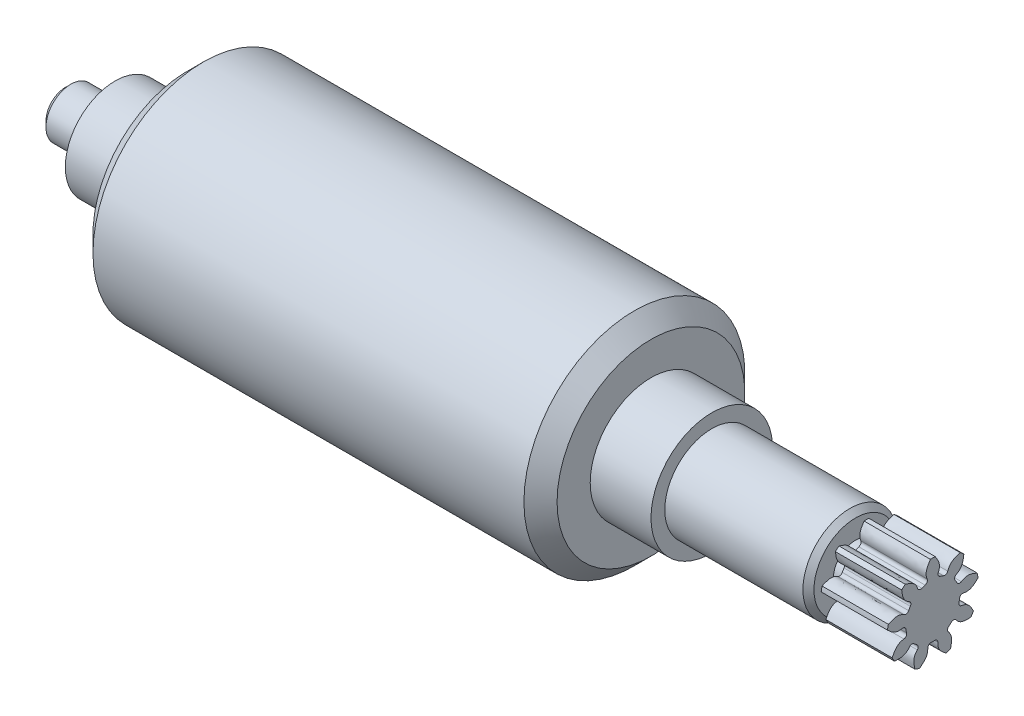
ISO-10303-21;
HEADER;
FILE_DESCRIPTION(('STEP AP214'),'2;1');
FILE_NAME('part.step','',(''),(''),'','','');
FILE_SCHEMA(('AUTOMOTIVE_DESIGN { 1 0 10303 214 1 1 1 1 }'));
ENDSEC;
DATA;
#1=APPLICATION_CONTEXT('core data for automotive mechanical design processes');
#2=APPLICATION_PROTOCOL_DEFINITION('international standard','automotive_design',2000,#1);
#3=PRODUCT_CONTEXT('',#1,'mechanical');
#4=PRODUCT('Part','Part','',(#3));
#5=PRODUCT_RELATED_PRODUCT_CATEGORY('part','',(#4));
#6=PRODUCT_DEFINITION_FORMATION('','',#4);
#7=PRODUCT_DEFINITION_CONTEXT('part definition',#1,'design');
#8=PRODUCT_DEFINITION('design','',#6,#7);
#9=PRODUCT_DEFINITION_SHAPE('','',#8);
#10=(LENGTH_UNIT() NAMED_UNIT(*) SI_UNIT(.MILLI.,.METRE.));
#11=(NAMED_UNIT(*) PLANE_ANGLE_UNIT() SI_UNIT($,.RADIAN.));
#12=(NAMED_UNIT(*) SI_UNIT($,.STERADIAN.) SOLID_ANGLE_UNIT());
#13=UNCERTAINTY_MEASURE_WITH_UNIT(LENGTH_MEASURE(1.E-05),#10,'distance_accuracy_value','');
#14=(GEOMETRIC_REPRESENTATION_CONTEXT(3) GLOBAL_UNCERTAINTY_ASSIGNED_CONTEXT((#13)) GLOBAL_UNIT_ASSIGNED_CONTEXT((#10,
#11,#12)) REPRESENTATION_CONTEXT('',''));
#15=CARTESIAN_POINT('',(0.,0.,0.));
#16=DIRECTION('',(0.,0.,1.));
#17=DIRECTION('',(1.,0.,0.));
#18=AXIS2_PLACEMENT_3D('',#15,#16,#17);
#19=CARTESIAN_POINT('',(0.,0.,0.));
#20=DIRECTION('',(-1.,0.,0.));
#21=DIRECTION('',(0.,0.,1.));
#22=AXIS2_PLACEMENT_3D('',#19,#20,#21);
#23=CYLINDRICAL_SURFACE('',#22,4.875);
#24=CARTESIAN_POINT('',(145.,0.,0.));
#25=DIRECTION('',(-1.,0.,0.));
#26=DIRECTION('',(0.,0.,1.));
#27=AXIS2_PLACEMENT_3D('',#24,#25,#26);
#28=CIRCLE('',#27,4.875);
#29=CARTESIAN_POINT('',(145.,2.70747831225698,-4.05403332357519));
#30=VERTEX_POINT('',#29);
#31=CARTESIAN_POINT('',(145.,2.17289227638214,-4.36396197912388));
#32=VERTEX_POINT('',#31);
#33=EDGE_CURVE('E840',#30,#32,#28,.T.);
#34=ORIENTED_EDGE('',*,*,#33,.F.);
#35=DIRECTION('',(-1.,0.,0.));
#36=VECTOR('',#35,1.);
#37=CARTESIAN_POINT('',(0.,2.70747831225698,-4.05403332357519));
#38=LINE('',#37,#36);
#39=CARTESIAN_POINT('',(157.,2.70747831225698,-4.05403332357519));
#40=VERTEX_POINT('',#39);
#41=EDGE_CURVE('E842',#30,#40,#38,.F.);
#42=ORIENTED_EDGE('',*,*,#41,.T.);
#43=CARTESIAN_POINT('',(157.,0.,0.));
#44=DIRECTION('',(-1.,0.,0.));
#45=DIRECTION('',(0.,0.,1.));
#46=AXIS2_PLACEMENT_3D('',#43,#44,#45);
#47=CIRCLE('',#46,4.875);
#48=CARTESIAN_POINT('',(157.,2.17289227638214,-4.36396197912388));
#49=VERTEX_POINT('',#48);
#50=EDGE_CURVE('E988',#40,#49,#47,.T.);
#51=ORIENTED_EDGE('',*,*,#50,.T.);
#52=DIRECTION('',(-1.,0.,0.));
#53=VECTOR('',#52,1.);
#54=CARTESIAN_POINT('',(0.,2.17289227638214,-4.36396197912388));
#55=LINE('',#54,#53);
#56=EDGE_CURVE('E844',#49,#32,#55,.T.);
#57=ORIENTED_EDGE('',*,*,#56,.T.);
#58=EDGE_LOOP('',(#34,#42,#51,#57));
#59=FACE_BOUND('',#58,.T.);
#60=ADVANCED_FACE('F40',(#59),#23,.T.);
#61=CARTESIAN_POINT('',(145.,-0.531833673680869,-4.84590321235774));
#62=VERTEX_POINT('',#61);
#63=CARTESIAN_POINT('',(145.,-1.1405686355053,-4.73969705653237));
#64=VERTEX_POINT('',#63);
#65=EDGE_CURVE('E847',#62,#64,#28,.T.);
#66=ORIENTED_EDGE('',*,*,#65,.F.);
#67=DIRECTION('',(-1.,0.,0.));
#68=VECTOR('',#67,1.);
#69=CARTESIAN_POINT('',(0.,-0.531833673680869,-4.84590321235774));
#70=LINE('',#69,#68);
#71=CARTESIAN_POINT('',(157.,-0.531833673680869,-4.84590321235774));
#72=VERTEX_POINT('',#71);
#73=EDGE_CURVE('E1145',#62,#72,#70,.F.);
#74=ORIENTED_EDGE('',*,*,#73,.T.);
#75=CARTESIAN_POINT('',(157.,-1.1405686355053,-4.73969705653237));
#76=VERTEX_POINT('',#75);
#77=EDGE_CURVE('E992',#72,#76,#47,.T.);
#78=ORIENTED_EDGE('',*,*,#77,.T.);
#79=DIRECTION('',(-1.,0.,0.));
#80=VECTOR('',#79,1.);
#81=CARTESIAN_POINT('',(0.,-1.1405686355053,-4.73969705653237));
#82=LINE('',#81,#80);
#83=EDGE_CURVE('E1123',#76,#64,#82,.T.);
#84=ORIENTED_EDGE('',*,*,#83,.T.);
#85=EDGE_LOOP('',(#66,#74,#78,#84));
#86=FACE_BOUND('',#85,.T.);
#87=ADVANCED_FACE('F830',(#86),#23,.T.);
#88=CARTESIAN_POINT('',(145.,-3.52229477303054,-3.37032113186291));
#89=VERTEX_POINT('',#88);
#90=CARTESIAN_POINT('',(145.,-3.9203448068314,-2.8976752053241));
#91=VERTEX_POINT('',#90);
#92=EDGE_CURVE('E1167',#89,#91,#28,.T.);
#93=ORIENTED_EDGE('',*,*,#92,.F.);
#94=DIRECTION('',(-1.,0.,0.));
#95=VECTOR('',#94,1.);
#96=CARTESIAN_POINT('',(0.,-3.52229477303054,-3.37032113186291));
#97=LINE('',#96,#95);
#98=CARTESIAN_POINT('',(157.,-3.52229477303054,-3.37032113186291));
#99=VERTEX_POINT('',#98);
#100=EDGE_CURVE('E1128',#89,#99,#97,.F.);
#101=ORIENTED_EDGE('',*,*,#100,.T.);
#102=CARTESIAN_POINT('',(157.,-3.9203448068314,-2.8976752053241));
#103=VERTEX_POINT('',#102);
#104=EDGE_CURVE('E1780',#99,#103,#47,.T.);
#105=ORIENTED_EDGE('',*,*,#104,.T.);
#106=DIRECTION('',(-1.,0.,0.));
#107=VECTOR('',#106,1.);
#108=CARTESIAN_POINT('',(0.,-3.9203448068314,-2.8976752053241));
#109=LINE('',#108,#107);
#110=EDGE_CURVE('E1104',#103,#91,#109,.T.);
#111=ORIENTED_EDGE('',*,*,#110,.T.);
#112=EDGE_LOOP('',(#93,#101,#105,#111));
#113=FACE_BOUND('',#112,.T.);
#114=ADVANCED_FACE('F835',(#113),#23,.T.);
#115=CARTESIAN_POINT('',(145.,-4.86463500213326,-0.317728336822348));
#116=VERTEX_POINT('',#115);
#117=CARTESIAN_POINT('',(145.,-4.86574807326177,0.300201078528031));
#118=VERTEX_POINT('',#117);
#119=EDGE_CURVE('E1833',#116,#118,#28,.T.);
#120=ORIENTED_EDGE('',*,*,#119,.F.);
#121=DIRECTION('',(-1.,0.,0.));
#122=VECTOR('',#121,1.);
#123=CARTESIAN_POINT('',(0.,-4.86463500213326,-0.317728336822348));
#124=LINE('',#123,#122);
#125=CARTESIAN_POINT('',(157.,-4.86463500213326,-0.317728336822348));
#126=VERTEX_POINT('',#125);
#127=EDGE_CURVE('E1109',#116,#126,#124,.F.);
#128=ORIENTED_EDGE('',*,*,#127,.T.);
#129=CARTESIAN_POINT('',(157.,-4.86574807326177,0.300201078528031));
#130=VERTEX_POINT('',#129);
#131=EDGE_CURVE('E1778',#126,#130,#47,.T.);
#132=ORIENTED_EDGE('',*,*,#131,.T.);
#133=DIRECTION('',(-1.,0.,0.));
#134=VECTOR('',#133,1.);
#135=CARTESIAN_POINT('',(0.,-4.86574807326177,0.300201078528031));
#136=LINE('',#135,#134);
#137=EDGE_CURVE('E1085',#130,#118,#136,.T.);
#138=ORIENTED_EDGE('',*,*,#137,.T.);
#139=EDGE_LOOP('',(#120,#128,#132,#138));
#140=FACE_BOUND('',#139,.T.);
#141=ADVANCED_FACE('F1654',(#140),#23,.T.);
#142=CARTESIAN_POINT('',(145.,-3.93075844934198,2.88353307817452));
#143=VERTEX_POINT('',#142);
#144=CARTESIAN_POINT('',(145.,-3.53441373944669,3.35760994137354));
#145=VERTEX_POINT('',#144);
#146=EDGE_CURVE('E1837',#143,#145,#28,.T.);
#147=ORIENTED_EDGE('',*,*,#146,.F.);
#148=DIRECTION('',(-1.,0.,0.));
#149=VECTOR('',#148,1.);
#150=CARTESIAN_POINT('',(0.,-3.93075844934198,2.88353307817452));
#151=LINE('',#150,#149);
#152=CARTESIAN_POINT('',(157.,-3.93075844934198,2.88353307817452));
#153=VERTEX_POINT('',#152);
#154=EDGE_CURVE('E1090',#143,#153,#151,.F.);
#155=ORIENTED_EDGE('',*,*,#154,.T.);
#156=CARTESIAN_POINT('',(157.,-3.53441373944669,3.35760994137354));
#157=VERTEX_POINT('',#156);
#158=EDGE_CURVE('E1777',#153,#157,#47,.T.);
#159=ORIENTED_EDGE('',*,*,#158,.T.);
#160=DIRECTION('',(-1.,0.,0.));
#161=VECTOR('',#160,1.);
#162=CARTESIAN_POINT('',(0.,-3.53441373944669,3.35760994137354));
#163=LINE('',#162,#161);
#164=EDGE_CURVE('E1066',#157,#145,#163,.T.);
#165=ORIENTED_EDGE('',*,*,#164,.T.);
#166=EDGE_LOOP('',(#147,#155,#159,#165));
#167=FACE_BOUND('',#166,.T.);
#168=ADVANCED_FACE('F1662',(#167),#23,.T.);
#169=CARTESIAN_POINT('',(145.,-1.15763633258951,4.73555731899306));
#170=VERTEX_POINT('',#169);
#171=CARTESIAN_POINT('',(145.,-0.549287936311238,4.84395579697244));
#172=VERTEX_POINT('',#171);
#173=EDGE_CURVE('E1775',#170,#172,#28,.T.);
#174=ORIENTED_EDGE('',*,*,#173,.F.);
#175=DIRECTION('',(-1.,0.,0.));
#176=VECTOR('',#175,1.);
#177=CARTESIAN_POINT('',(0.,-1.15763633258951,4.73555731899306));
#178=LINE('',#177,#176);
#179=CARTESIAN_POINT('',(157.,-1.15763633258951,4.73555731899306));
#180=VERTEX_POINT('',#179);
#181=EDGE_CURVE('E1071',#170,#180,#178,.F.);
#182=ORIENTED_EDGE('',*,*,#181,.T.);
#183=CARTESIAN_POINT('',(157.,-0.549287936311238,4.84395579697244));
#184=VERTEX_POINT('',#183);
#185=EDGE_CURVE('E1000',#180,#184,#47,.T.);
#186=ORIENTED_EDGE('',*,*,#185,.T.);
#187=DIRECTION('',(-1.,0.,0.));
#188=VECTOR('',#187,1.);
#189=CARTESIAN_POINT('',(0.,-0.549287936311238,4.84395579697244));
#190=LINE('',#189,#188);
#191=EDGE_CURVE('E1047',#184,#172,#190,.T.);
#192=ORIENTED_EDGE('',*,*,#191,.T.);
#193=EDGE_LOOP('',(#174,#182,#186,#192));
#194=FACE_BOUND('',#193,.T.);
#195=ADVANCED_FACE('F1670',(#194),#23,.T.);
#196=CARTESIAN_POINT('',(145.,2.15715668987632,4.37176166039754));
#197=VERTEX_POINT('',#196);
#198=CARTESIAN_POINT('',(145.,2.69285579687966,4.06376090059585));
#199=VERTEX_POINT('',#198);
#200=EDGE_CURVE('E991',#197,#199,#28,.T.);
#201=ORIENTED_EDGE('',*,*,#200,.F.);
#202=DIRECTION('',(-1.,0.,0.));
#203=VECTOR('',#202,1.);
#204=CARTESIAN_POINT('',(0.,2.15715668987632,4.37176166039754));
#205=LINE('',#204,#203);
#206=CARTESIAN_POINT('',(157.,2.15715668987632,4.37176166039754));
#207=VERTEX_POINT('',#206);
#208=EDGE_CURVE('E1052',#197,#207,#205,.F.);
#209=ORIENTED_EDGE('',*,*,#208,.T.);
#210=CARTESIAN_POINT('',(157.,2.69285579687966,4.06376090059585));
#211=VERTEX_POINT('',#210);
#212=EDGE_CURVE('E994',#207,#211,#47,.T.);
#213=ORIENTED_EDGE('',*,*,#212,.T.);
#214=DIRECTION('',(-1.,0.,0.));
#215=VECTOR('',#214,1.);
#216=CARTESIAN_POINT('',(0.,2.69285579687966,4.06376090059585));
#217=LINE('',#216,#215);
#218=EDGE_CURVE('E1024',#211,#199,#217,.T.);
#219=ORIENTED_EDGE('',*,*,#218,.T.);
#220=EDGE_LOOP('',(#201,#209,#213,#219));
#221=FACE_BOUND('',#220,.T.);
#222=ADVANCED_FACE('F1678',(#221),#23,.T.);
#223=CARTESIAN_POINT('',(145.,4.46259212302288,1.9623701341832));
#224=VERTEX_POINT('',#223);
#225=CARTESIAN_POINT('',(145.,4.67498237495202,1.3820871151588));
#226=VERTEX_POINT('',#225);
#227=EDGE_CURVE('E987',#224,#226,#28,.T.);
#228=ORIENTED_EDGE('',*,*,#227,.F.);
#229=DIRECTION('',(-1.,0.,0.));
#230=VECTOR('',#229,1.);
#231=CARTESIAN_POINT('',(0.,4.46259212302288,1.9623701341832));
#232=LINE('',#231,#230);
#233=CARTESIAN_POINT('',(157.,4.46259212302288,1.9623701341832));
#234=VERTEX_POINT('',#233);
#235=EDGE_CURVE('E1034',#224,#234,#232,.F.);
#236=ORIENTED_EDGE('',*,*,#235,.T.);
#237=CARTESIAN_POINT('',(157.,4.67498237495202,1.3820871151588));
#238=VERTEX_POINT('',#237);
#239=EDGE_CURVE('E990',#234,#238,#47,.T.);
#240=ORIENTED_EDGE('',*,*,#239,.T.);
#241=DIRECTION('',(-1.,0.,0.));
#242=VECTOR('',#241,1.);
#243=CARTESIAN_POINT('',(0.,4.67498237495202,1.3820871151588));
#244=LINE('',#243,#242);
#245=EDGE_CURVE('E1711',#238,#226,#244,.T.);
#246=ORIENTED_EDGE('',*,*,#245,.T.);
#247=EDGE_LOOP('',(#228,#236,#240,#246));
#248=FACE_BOUND('',#247,.T.);
#249=ADVANCED_FACE('F778',(#248),#23,.T.);
#250=CARTESIAN_POINT('',(0.,0.,0.));
#251=DIRECTION('',(1.,0.,0.));
#252=DIRECTION('',(0.,0.,-1.));
#253=AXIS2_PLACEMENT_3D('',#250,#251,#252);
#254=PLANE('',#253);
#255=CARTESIAN_POINT('',(0.,0.,0.));
#256=DIRECTION('',(1.,0.,0.));
#257=DIRECTION('',(0.,0.,-1.));
#258=AXIS2_PLACEMENT_3D('',#255,#256,#257);
#259=CIRCLE('',#258,3.5);
#260=CARTESIAN_POINT('',(0.,0.,-3.5));
#261=VERTEX_POINT('',#260);
#262=EDGE_CURVE('E48',#261,#261,#259,.F.);
#263=ORIENTED_EDGE('',*,*,#262,.T.);
#264=EDGE_LOOP('',(#263));
#265=FACE_BOUND('',#264,.T.);
#266=ADVANCED_FACE('F42',(#265),#254,.F.);
#267=CARTESIAN_POINT('',(0.,0.,0.));
#268=DIRECTION('',(-1.,0.,0.));
#269=DIRECTION('',(0.,0.,1.));
#270=AXIS2_PLACEMENT_3D('',#267,#268,#269);
#271=CYLINDRICAL_SURFACE('',#270,4.5);
#272=CARTESIAN_POINT('',(1.,0.,0.));
#273=DIRECTION('',(1.,0.,0.));
#274=DIRECTION('',(0.,0.,-1.));
#275=AXIS2_PLACEMENT_3D('',#272,#273,#274);
#276=CIRCLE('',#275,4.5);
#277=CARTESIAN_POINT('',(1.,0.,-4.5));
#278=VERTEX_POINT('',#277);
#279=EDGE_CURVE('E12',#278,#278,#276,.T.);
#280=ORIENTED_EDGE('',*,*,#279,.T.);
#281=EDGE_LOOP('',(#280));
#282=FACE_BOUND('',#281,.T.);
#283=CARTESIAN_POINT('',(9.,0.,0.));
#284=DIRECTION('',(-1.,0.,0.));
#285=DIRECTION('',(0.,0.,1.));
#286=AXIS2_PLACEMENT_3D('',#283,#284,#285);
#287=CIRCLE('',#286,4.5);
#288=CARTESIAN_POINT('',(9.,0.,4.5));
#289=VERTEX_POINT('',#288);
#290=EDGE_CURVE('E1860',#289,#289,#287,.T.);
#291=ORIENTED_EDGE('',*,*,#290,.T.);
#292=EDGE_LOOP('',(#291));
#293=FACE_BOUND('',#292,.T.);
#294=ADVANCED_FACE('F820',(#282,#293),#271,.T.);
#295=CARTESIAN_POINT('',(9.,4.5,0.));
#296=DIRECTION('',(1.,0.,0.));
#297=DIRECTION('',(0.,0.,-1.));
#298=AXIS2_PLACEMENT_3D('',#295,#296,#297);
#299=PLANE('',#298);
#300=ORIENTED_EDGE('',*,*,#290,.F.);
#301=EDGE_LOOP('',(#300));
#302=FACE_BOUND('',#301,.T.);
#303=CARTESIAN_POINT('',(9.,0.,0.));
#304=DIRECTION('',(-1.,0.,0.));
#305=DIRECTION('',(0.,0.,1.));
#306=AXIS2_PLACEMENT_3D('',#303,#304,#305);
#307=CIRCLE('',#306,9.);
#308=CARTESIAN_POINT('',(9.,0.,9.));
#309=VERTEX_POINT('',#308);
#310=EDGE_CURVE('E1857',#309,#309,#307,.T.);
#311=ORIENTED_EDGE('',*,*,#310,.T.);
#312=EDGE_LOOP('',(#311));
#313=FACE_BOUND('',#312,.T.);
#314=ADVANCED_FACE('F817',(#302,#313),#299,.F.);
#315=CARTESIAN_POINT('',(0.,0.,0.));
#316=DIRECTION('',(-1.,0.,0.));
#317=DIRECTION('',(0.,0.,1.));
#318=AXIS2_PLACEMENT_3D('',#315,#316,#317);
#319=CYLINDRICAL_SURFACE('',#318,9.);
#320=ORIENTED_EDGE('',*,*,#310,.F.);
#321=EDGE_LOOP('',(#320));
#322=FACE_BOUND('',#321,.T.);
#323=CARTESIAN_POINT('',(22.,0.,0.));
#324=DIRECTION('',(-1.,0.,0.));
#325=DIRECTION('',(0.,0.,1.));
#326=AXIS2_PLACEMENT_3D('',#323,#324,#325);
#327=CIRCLE('',#326,9.);
#328=CARTESIAN_POINT('',(22.,0.,9.));
#329=VERTEX_POINT('',#328);
#330=EDGE_CURVE('E1854',#329,#329,#327,.T.);
#331=ORIENTED_EDGE('',*,*,#330,.T.);
#332=EDGE_LOOP('',(#331));
#333=FACE_BOUND('',#332,.T.);
#334=ADVANCED_FACE('F813',(#322,#333),#319,.T.);
#335=CARTESIAN_POINT('',(22.,9.,0.));
#336=DIRECTION('',(1.,0.,0.));
#337=DIRECTION('',(0.,0.,-1.));
#338=AXIS2_PLACEMENT_3D('',#335,#336,#337);
#339=PLANE('',#338);
#340=CARTESIAN_POINT('',(22.,0.,0.));
#341=DIRECTION('',(1.,0.,0.));
#342=DIRECTION('',(0.,0.,-1.));
#343=AXIS2_PLACEMENT_3D('',#340,#341,#342);
#344=CIRCLE('',#343,17.);
#345=CARTESIAN_POINT('',(22.,0.,-17.));
#346=VERTEX_POINT('',#345);
#347=EDGE_CURVE('E866',#346,#346,#344,.F.);
#348=ORIENTED_EDGE('',*,*,#347,.T.);
#349=EDGE_LOOP('',(#348));
#350=FACE_BOUND('',#349,.T.);
#351=ORIENTED_EDGE('',*,*,#330,.F.);
#352=EDGE_LOOP('',(#351));
#353=FACE_BOUND('',#352,.T.);
#354=ADVANCED_FACE('F809',(#350,#353),#339,.F.);
#355=CARTESIAN_POINT('',(0.,0.,0.));
#356=DIRECTION('',(-1.,0.,0.));
#357=DIRECTION('',(0.,0.,1.));
#358=AXIS2_PLACEMENT_3D('',#355,#356,#357);
#359=CYLINDRICAL_SURFACE('',#358,20.);
#360=CARTESIAN_POINT('',(25.,0.,0.));
#361=DIRECTION('',(1.,0.,0.));
#362=DIRECTION('',(0.,0.,-1.));
#363=AXIS2_PLACEMENT_3D('',#360,#361,#362);
#364=CIRCLE('',#363,20.);
#365=CARTESIAN_POINT('',(25.,0.,-20.));
#366=VERTEX_POINT('',#365);
#367=EDGE_CURVE('E872',#366,#366,#364,.T.);
#368=ORIENTED_EDGE('',*,*,#367,.T.);
#369=EDGE_LOOP('',(#368));
#370=FACE_BOUND('',#369,.T.);
#371=CARTESIAN_POINT('',(103.,0.,0.));
#372=DIRECTION('',(-1.,0.,0.));
#373=DIRECTION('',(0.,0.,1.));
#374=AXIS2_PLACEMENT_3D('',#371,#372,#373);
#375=CIRCLE('',#374,20.);
#376=CARTESIAN_POINT('',(103.,0.,20.));
#377=VERTEX_POINT('',#376);
#378=EDGE_CURVE('E869',#377,#377,#375,.T.);
#379=ORIENTED_EDGE('',*,*,#378,.T.);
#380=EDGE_LOOP('',(#379));
#381=FACE_BOUND('',#380,.T.);
#382=ADVANCED_FACE('F805',(#370,#381),#359,.T.);
#383=CARTESIAN_POINT('',(106.,20.,0.));
#384=DIRECTION('',(-1.,0.,0.));
#385=DIRECTION('',(0.,0.,1.));
#386=AXIS2_PLACEMENT_3D('',#383,#384,#385);
#387=PLANE('',#386);
#388=CARTESIAN_POINT('',(106.,0.,0.));
#389=DIRECTION('',(-1.,0.,0.));
#390=DIRECTION('',(0.,0.,1.));
#391=AXIS2_PLACEMENT_3D('',#388,#389,#390);
#392=CIRCLE('',#391,17.);
#393=CARTESIAN_POINT('',(106.,0.,17.));
#394=VERTEX_POINT('',#393);
#395=EDGE_CURVE('E875',#394,#394,#392,.F.);
#396=ORIENTED_EDGE('',*,*,#395,.T.);
#397=EDGE_LOOP('',(#396));
#398=FACE_BOUND('',#397,.T.);
#399=CARTESIAN_POINT('',(106.,0.,0.));
#400=DIRECTION('',(-1.,0.,0.));
#401=DIRECTION('',(0.,0.,1.));
#402=AXIS2_PLACEMENT_3D('',#399,#400,#401);
#403=CIRCLE('',#402,11.);
#404=CARTESIAN_POINT('',(106.,0.,11.));
#405=VERTEX_POINT('',#404);
#406=EDGE_CURVE('E1851',#405,#405,#403,.T.);
#407=ORIENTED_EDGE('',*,*,#406,.T.);
#408=EDGE_LOOP('',(#407));
#409=FACE_BOUND('',#408,.T.);
#410=ADVANCED_FACE('F801',(#398,#409),#387,.F.);
#411=CARTESIAN_POINT('',(0.,0.,0.));
#412=DIRECTION('',(-1.,0.,0.));
#413=DIRECTION('',(0.,0.,1.));
#414=AXIS2_PLACEMENT_3D('',#411,#412,#413);
#415=CYLINDRICAL_SURFACE('',#414,11.);
#416=ORIENTED_EDGE('',*,*,#406,.F.);
#417=EDGE_LOOP('',(#416));
#418=FACE_BOUND('',#417,.T.);
#419=CARTESIAN_POINT('',(117.,0.,0.));
#420=DIRECTION('',(-1.,0.,0.));
#421=DIRECTION('',(0.,0.,1.));
#422=AXIS2_PLACEMENT_3D('',#419,#420,#421);
#423=CIRCLE('',#422,11.);
#424=CARTESIAN_POINT('',(117.,0.,11.));
#425=VERTEX_POINT('',#424);
#426=EDGE_CURVE('E1848',#425,#425,#423,.T.);
#427=ORIENTED_EDGE('',*,*,#426,.T.);
#428=EDGE_LOOP('',(#427));
#429=FACE_BOUND('',#428,.T.);
#430=ADVANCED_FACE('F797',(#418,#429),#415,.T.);
#431=CARTESIAN_POINT('',(117.,11.,0.));
#432=DIRECTION('',(-1.,0.,0.));
#433=DIRECTION('',(0.,0.,1.));
#434=AXIS2_PLACEMENT_3D('',#431,#432,#433);
#435=PLANE('',#434);
#436=ORIENTED_EDGE('',*,*,#426,.F.);
#437=EDGE_LOOP('',(#436));
#438=FACE_BOUND('',#437,.T.);
#439=CARTESIAN_POINT('',(117.,0.,0.));
#440=DIRECTION('',(-1.,0.,0.));
#441=DIRECTION('',(0.,0.,1.));
#442=AXIS2_PLACEMENT_3D('',#439,#440,#441);
#443=CIRCLE('',#442,8.5);
#444=CARTESIAN_POINT('',(117.,0.,8.5));
#445=VERTEX_POINT('',#444);
#446=EDGE_CURVE('E1845',#445,#445,#443,.T.);
#447=ORIENTED_EDGE('',*,*,#446,.T.);
#448=EDGE_LOOP('',(#447));
#449=FACE_BOUND('',#448,.T.);
#450=ADVANCED_FACE('F793',(#438,#449),#435,.F.);
#451=CARTESIAN_POINT('',(0.,0.,0.));
#452=DIRECTION('',(-1.,0.,0.));
#453=DIRECTION('',(0.,0.,1.));
#454=AXIS2_PLACEMENT_3D('',#451,#452,#453);
#455=CYLINDRICAL_SURFACE('',#454,8.5);
#456=CARTESIAN_POINT('',(142.,0.,0.));
#457=DIRECTION('',(-1.,0.,0.));
#458=DIRECTION('',(0.,0.,1.));
#459=AXIS2_PLACEMENT_3D('',#456,#457,#458);
#460=CIRCLE('',#459,8.5);
#461=CARTESIAN_POINT('',(142.,0.,8.5));
#462=VERTEX_POINT('',#461);
#463=EDGE_CURVE('E878',#462,#462,#460,.T.);
#464=ORIENTED_EDGE('',*,*,#463,.T.);
#465=EDGE_LOOP('',(#464));
#466=FACE_BOUND('',#465,.T.);
#467=ORIENTED_EDGE('',*,*,#446,.F.);
#468=EDGE_LOOP('',(#467));
#469=FACE_BOUND('',#468,.T.);
#470=ADVANCED_FACE('F789',(#466,#469),#455,.T.);
#471=CARTESIAN_POINT('',(143.,8.5,0.));
#472=DIRECTION('',(-1.,0.,0.));
#473=DIRECTION('',(0.,0.,1.));
#474=AXIS2_PLACEMENT_3D('',#471,#472,#473);
#475=PLANE('',#474);
#476=CARTESIAN_POINT('',(143.,0.,0.));
#477=DIRECTION('',(-1.,0.,0.));
#478=DIRECTION('',(0.,0.,1.));
#479=AXIS2_PLACEMENT_3D('',#476,#477,#478);
#480=CIRCLE('',#479,7.50000000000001);
#481=CARTESIAN_POINT('',(143.,0.,7.50000000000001));
#482=VERTEX_POINT('',#481);
#483=EDGE_CURVE('E881',#482,#482,#480,.F.);
#484=ORIENTED_EDGE('',*,*,#483,.T.);
#485=EDGE_LOOP('',(#484));
#486=FACE_BOUND('',#485,.T.);
#487=CARTESIAN_POINT('',(143.,0.,0.));
#488=DIRECTION('',(-1.,0.,0.));
#489=DIRECTION('',(0.,0.,1.));
#490=AXIS2_PLACEMENT_3D('',#487,#488,#489);
#491=CIRCLE('',#490,4.);
#492=CARTESIAN_POINT('',(143.,0.,4.));
#493=VERTEX_POINT('',#492);
#494=EDGE_CURVE('E1842',#493,#493,#491,.T.);
#495=ORIENTED_EDGE('',*,*,#494,.T.);
#496=EDGE_LOOP('',(#495));
#497=FACE_BOUND('',#496,.T.);
#498=ADVANCED_FACE('F785',(#486,#497),#475,.F.);
#499=CARTESIAN_POINT('',(0.,0.,0.));
#500=DIRECTION('',(-1.,0.,0.));
#501=DIRECTION('',(0.,0.,1.));
#502=AXIS2_PLACEMENT_3D('',#499,#500,#501);
#503=CYLINDRICAL_SURFACE('',#502,4.);
#504=ORIENTED_EDGE('',*,*,#494,.F.);
#505=EDGE_LOOP('',(#504));
#506=FACE_BOUND('',#505,.T.);
#507=CARTESIAN_POINT('',(145.,0.,0.));
#508=DIRECTION('',(-1.,0.,0.));
#509=DIRECTION('',(0.,0.,1.));
#510=AXIS2_PLACEMENT_3D('',#507,#508,#509);
#511=CIRCLE('',#510,4.);
#512=CARTESIAN_POINT('',(145.,0.,4.));
#513=VERTEX_POINT('',#512);
#514=EDGE_CURVE('E1839',#513,#513,#511,.T.);
#515=ORIENTED_EDGE('',*,*,#514,.T.);
#516=EDGE_LOOP('',(#515));
#517=FACE_BOUND('',#516,.T.);
#518=ADVANCED_FACE('F781',(#506,#517),#503,.T.);
#519=CARTESIAN_POINT('',(145.,4.,0.));
#520=DIRECTION('',(1.,0.,0.));
#521=DIRECTION('',(0.,0.,-1.));
#522=AXIS2_PLACEMENT_3D('',#519,#520,#521);
#523=PLANE('',#522);
#524=CARTESIAN_POINT('',(145.,2.95343350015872,-3.04240531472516));
#525=CARTESIAN_POINT('',(145.,3.31208982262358,-3.66361628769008));
#526=CARTESIAN_POINT('',(145.,3.51457912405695,-4.58248146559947));
#527=CARTESIAN_POINT('',(145.,4.69357264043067,-5.45874692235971));
#528=CARTESIAN_POINT('',(145.,5.43473644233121,-5.551706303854));
#529=CARTESIAN_POINT('',(145.,6.03338421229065,-5.6267908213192));
#530=B_SPLINE_CURVE_WITH_KNOTS('',3,(#524,#525,#526,#527,#528,#529),.UNSPECIFIED.,.F.,.F.,(4,1,
1,4),(0.,0.497114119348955,0.593812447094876,1.),.UNSPECIFIED.);
#531=CARTESIAN_POINT('',(145.,6.03338421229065,-5.6267908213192));
#532=VERTEX_POINT('',#531);
#533=CARTESIAN_POINT('',(145.,3.53047797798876,-4.26646041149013));
#534=VERTEX_POINT('',#533);
#535=EDGE_CURVE('E390',#532,#534,#530,.F.);
#536=ORIENTED_EDGE('',*,*,#535,.T.);
#537=CARTESIAN_POINT('',(145.,3.02404500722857,-4.52804337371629));
#538=DIRECTION('',(1.,0.,0.));
#539=DIRECTION('',(0.,0.,-1.));
#540=AXIS2_PLACEMENT_3D('',#537,#538,#539);
#541=CIRCLE('',#540,0.57);
#542=EDGE_CURVE('E852',#534,#30,#541,.T.);
#543=ORIENTED_EDGE('',*,*,#542,.T.);
#544=ORIENTED_EDGE('',*,*,#33,.T.);
#545=CARTESIAN_POINT('',(145.,2.42695352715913,-4.87420984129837));
#546=DIRECTION('',(1.,0.,0.));
#547=DIRECTION('',(0.,0.,-1.));
#548=AXIS2_PLACEMENT_3D('',#545,#546,#547);
#549=CIRCLE('',#548,0.57);
#550=CARTESIAN_POINT('',(145.,1.93982956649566,-5.17020012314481));
#551=VERTEX_POINT('',#550);
#552=EDGE_CURVE('E1150',#32,#551,#549,.T.);
#553=ORIENTED_EDGE('',*,*,#552,.T.);
#554=CARTESIAN_POINT('',(145.,1.85625168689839,-8.03845940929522));
#555=CARTESIAN_POINT('',(145.,2.09144847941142,-7.48190135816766));
#556=CARTESIAN_POINT('',(145.,2.38263698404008,-6.7928472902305));
#557=CARTESIAN_POINT('',(145.,2.20726501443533,-5.3374958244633));
#558=CARTESIAN_POINT('',(145.,1.56907207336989,-4.66685062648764));
#559=CARTESIAN_POINT('',(145.,1.15808354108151,-4.078951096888));
#560=B_SPLINE_CURVE_WITH_KNOTS('',3,(#554,#555,#556,#557,#558,#559),.UNSPECIFIED.,.F.,.F.,(4,1,
1,4),(0.,0.406187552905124,0.502885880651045,1.),.UNSPECIFIED.);
#561=CARTESIAN_POINT('',(145.,1.85625168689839,-8.03845940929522));
#562=VERTEX_POINT('',#561);
#563=EDGE_CURVE('E449',#551,#562,#560,.F.);
#564=ORIENTED_EDGE('',*,*,#563,.T.);
#565=CARTESIAN_POINT('',(145.,0.,0.));
#566=DIRECTION('',(1.,0.,0.));
#567=DIRECTION('',(0.,0.,-1.));
#568=AXIS2_PLACEMENT_3D('',#565,#566,#567);
#569=CIRCLE('',#568,8.25);
#570=CARTESIAN_POINT('',(145.,1.00500902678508,-8.18855645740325));
#571=VERTEX_POINT('',#570);
#572=EDGE_CURVE('E454',#562,#571,#569,.F.);
#573=ORIENTED_EDGE('',*,*,#572,.T.);
#574=CARTESIAN_POINT('',(145.,0.306840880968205,-4.22904814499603));
#575=CARTESIAN_POINT('',(145.,0.182280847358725,-4.93546319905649));
#576=CARTESIAN_POINT('',(145.,-0.253238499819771,-5.76951237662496));
#577=CARTESIAN_POINT('',(145.,0.0866703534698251,-7.19861308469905));
#578=CARTESIAN_POINT('',(145.,0.594681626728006,-7.74623501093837));
#579=CARTESIAN_POINT('',(145.,1.00500902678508,-8.18855645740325));
#580=B_SPLINE_CURVE_WITH_KNOTS('',3,(#574,#575,#576,#577,#578,#579),.UNSPECIFIED.,.F.,.F.,(4,1,
1,4),(0.,0.497114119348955,0.593812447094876,1.),.UNSPECIFIED.);
#581=CARTESIAN_POINT('',(145.,-0.0379248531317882,-5.53764579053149));
#582=VERTEX_POINT('',#581);
#583=EDGE_CURVE('E457',#571,#582,#580,.F.);
#584=ORIENTED_EDGE('',*,*,#583,.T.);
#585=CARTESIAN_POINT('',(145.,-0.59401730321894,-5.41250112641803));
#586=DIRECTION('',(1.,0.,0.));
#587=DIRECTION('',(0.,0.,-1.));
#588=AXIS2_PLACEMENT_3D('',#585,#586,#587);
#589=CIRCLE('',#588,0.57);
#590=EDGE_CURVE('E1157',#582,#62,#589,.T.);
#591=ORIENTED_EDGE('',*,*,#590,.T.);
#592=ORIENTED_EDGE('',*,*,#65,.T.);
#593=CARTESIAN_POINT('',(145.,-1.27392742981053,-5.29387702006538));
#594=DIRECTION('',(1.,0.,0.));
#595=DIRECTION('',(0.,0.,-1.));
#596=AXIS2_PLACEMENT_3D('',#593,#594,#595);
#597=CIRCLE('',#596,0.57);
#598=CARTESIAN_POINT('',(145.,-1.83734491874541,-5.20750148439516));
#599=VERTEX_POINT('',#598);
#600=EDGE_CURVE('E1133',#64,#599,#597,.T.);
#601=ORIENTED_EDGE('',*,*,#600,.T.);
#602=CARTESIAN_POINT('',(145.,-3.74505081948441,-7.35099274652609));
#603=CARTESIAN_POINT('',(145.,-3.20713100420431,-7.07582612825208));
#604=CARTESIAN_POINT('',(145.,-2.5411522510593,-6.73515245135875));
#605=CARTESIAN_POINT('',(145.,-1.74001308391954,-5.50756161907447));
#606=CARTESIAN_POINT('',(145.,-1.79781481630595,-4.58359507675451));
#607=CARTESIAN_POINT('',(145.,-1.73475576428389,-3.86905957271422));
#608=B_SPLINE_CURVE_WITH_KNOTS('',3,(#602,#603,#604,#605,#606,#607),.UNSPECIFIED.,.F.,.F.,(4,1,
1,4),(0.,0.406187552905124,0.502885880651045,1.),.UNSPECIFIED.);
#609=CARTESIAN_POINT('',(145.,-3.74505081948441,-7.35099274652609));
#610=VERTEX_POINT('',#609);
#611=EDGE_CURVE('E458',#599,#610,#608,.F.);
#612=ORIENTED_EDGE('',*,*,#611,.T.);
#613=CARTESIAN_POINT('',(145.,0.,0.));
#614=DIRECTION('',(1.,0.,0.));
#615=DIRECTION('',(0.,0.,-1.));
#616=AXIS2_PLACEMENT_3D('',#613,#614,#615);
#617=CIRCLE('',#616,8.25);
#618=CARTESIAN_POINT('',(145.,-4.4936210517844,-6.91880552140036));
#619=VERTEX_POINT('',#618);
#620=EDGE_CURVE('E471',#610,#619,#617,.F.);
#621=ORIENTED_EDGE('',*,*,#620,.T.);
#622=CARTESIAN_POINT('',(145.,-2.48332599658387,-3.43687234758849));
#623=CARTESIAN_POINT('',(145.,-3.03281936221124,-3.89795202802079));
#624=CARTESIAN_POINT('',(145.,-3.90256301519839,-4.25692432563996));
#625=CARTESIAN_POINT('',(145.,-4.56078595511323,-5.57016818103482));
#626=CARTESIAN_POINT('',(145.,-4.52363133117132,-6.316214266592));
#627=CARTESIAN_POINT('',(145.,-4.4936210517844,-6.91880552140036));
#628=B_SPLINE_CURVE_WITH_KNOTS('',3,(#622,#623,#624,#625,#626,#627),.UNSPECIFIED.,.F.,.F.,(4,1,
1,4),(0.,0.497114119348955,0.593812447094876,1.),.UNSPECIFIED.);
#629=CARTESIAN_POINT('',(145.,-3.58858222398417,-4.21770516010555));
#630=VERTEX_POINT('',#629);
#631=EDGE_CURVE('E462',#619,#630,#628,.F.);
#632=ORIENTED_EDGE('',*,*,#631,.T.);
#633=CARTESIAN_POINT('',(145.,-3.93413231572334,-3.76438944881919));
#634=DIRECTION('',(1.,0.,0.));
#635=DIRECTION('',(0.,0.,-1.));
#636=AXIS2_PLACEMENT_3D('',#633,#634,#635);
#637=CIRCLE('',#636,0.57);
#638=EDGE_CURVE('E1140',#630,#89,#637,.T.);
#639=ORIENTED_EDGE('',*,*,#638,.T.);
#640=ORIENTED_EDGE('',*,*,#92,.T.);
#641=CARTESIAN_POINT('',(145.,-4.37872358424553,-3.2364803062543));
#642=DIRECTION('',(1.,0.,0.));
#643=DIRECTION('',(0.,0.,-1.));
#644=AXIS2_PLACEMENT_3D('',#641,#642,#643);
#645=CIRCLE('',#644,0.57);
#646=CARTESIAN_POINT('',(145.,-4.75480529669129,-2.80815502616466));
#647=VERTEX_POINT('',#646);
#648=EDGE_CURVE('E1114',#91,#647,#645,.T.);
#649=ORIENTED_EDGE('',*,*,#648,.T.);
#650=CARTESIAN_POINT('',(145.,-7.59400242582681,-3.22391488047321));
#651=CARTESIAN_POINT('',(145.,-7.00505824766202,-3.35889321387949));
#652=CARTESIAN_POINT('',(145.,-6.27590810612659,-3.52600492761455));
#653=CARTESIAN_POINT('',(145.,-4.87311972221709,-3.10057812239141));
#654=CARTESIAN_POINT('',(145.,-4.32348417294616,-2.35562444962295));
#655=CARTESIAN_POINT('',(145.,-3.81588356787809,-1.84879207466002));
#656=B_SPLINE_CURVE_WITH_KNOTS('',3,(#650,#651,#652,#653,#654,#655),.UNSPECIFIED.,.F.,.F.,(4,1,
1,4),(0.,0.406187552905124,0.502885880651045,1.),.UNSPECIFIED.);
#657=CARTESIAN_POINT('',(145.,-7.59400242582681,-3.22391488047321));
#658=VERTEX_POINT('',#657);
#659=EDGE_CURVE('E535',#647,#658,#656,.F.);
#660=ORIENTED_EDGE('',*,*,#659,.T.);
#661=CARTESIAN_POINT('',(145.,0.,0.));
#662=DIRECTION('',(1.,0.,0.));
#663=DIRECTION('',(0.,0.,-1.));
#664=AXIS2_PLACEMENT_3D('',#661,#662,#663);
#665=CIRCLE('',#664,8.25);
#666=CARTESIAN_POINT('',(145.,-7.88963589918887,-2.41166858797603));
#667=VERTEX_POINT('',#666);
#668=EDGE_CURVE('E540',#658,#667,#665,.F.);
#669=ORIENTED_EDGE('',*,*,#668,.T.);
#670=CARTESIAN_POINT('',(145.,-4.11151704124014,-1.03654578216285));
#671=CARTESIAN_POINT('',(145.,-4.82882968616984,-1.03654578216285));
#672=CARTESIAN_POINT('',(145.,-5.72583492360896,-0.752474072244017));
#673=CARTESIAN_POINT('',(145.,-7.07419982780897,-1.33537967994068));
#674=CARTESIAN_POINT('',(145.,-7.52528691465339,-1.93076667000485));
#675=CARTESIAN_POINT('',(145.,-7.88963589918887,-2.41166858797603));
#676=B_SPLINE_CURVE_WITH_KNOTS('',3,(#670,#671,#672,#673,#674,#675),.UNSPECIFIED.,.F.,.F.,(4,1,
1,4),(0.,0.497114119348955,0.593812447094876,1.),.UNSPECIFIED.);
#677=CARTESIAN_POINT('',(145.,-5.46010208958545,-0.924253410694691));
#678=VERTEX_POINT('',#677);
#679=EDGE_CURVE('E543',#667,#678,#676,.F.);
#680=ORIENTED_EDGE('',*,*,#679,.T.);
#681=CARTESIAN_POINT('',(145.,-5.43342309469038,-0.354878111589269));
#682=DIRECTION('',(1.,0.,0.));
#683=DIRECTION('',(0.,0.,-1.));
#684=AXIS2_PLACEMENT_3D('',#681,#682,#683);
#685=CIRCLE('',#684,0.57);
#686=EDGE_CURVE('E1121',#678,#116,#685,.T.);
#687=ORIENTED_EDGE('',*,*,#686,.T.);
#688=ORIENTED_EDGE('',*,*,#119,.T.);
#689=CARTESIAN_POINT('',(145.,-5.43466630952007,0.335301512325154));
#690=DIRECTION('',(1.,0.,0.));
#691=DIRECTION('',(0.,0.,-1.));
#692=AXIS2_PLACEMENT_3D('',#689,#690,#691);
#693=CIRCLE('',#692,0.57);
#694=CARTESIAN_POINT('',(145.,-5.44743943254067,0.90515837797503));
#695=VERTEX_POINT('',#694);
#696=EDGE_CURVE('E1095',#118,#695,#693,.T.);
#697=ORIENTED_EDGE('',*,*,#696,.T.);
#698=CARTESIAN_POINT('',(145.,-7.8896358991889,2.41166858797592));
#699=CARTESIAN_POINT('',(145.,-7.52524088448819,1.92970316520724));
#700=CARTESIAN_POINT('',(145.,-7.07409680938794,1.33299948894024));
#701=CARTESIAN_POINT('',(145.,-5.72603948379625,0.75720033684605));
#702=CARTESIAN_POINT('',(145.,-4.82614723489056,0.974569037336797));
#703=CARTESIAN_POINT('',(145.,-4.11151704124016,1.03654578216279));
#704=B_SPLINE_CURVE_WITH_KNOTS('',3,(#698,#699,#700,#701,#702,#703),.UNSPECIFIED.,.F.,.F.,(4,1,
1,4),(0.,0.406187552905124,0.502885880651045,1.),.UNSPECIFIED.);
#705=CARTESIAN_POINT('',(145.,-7.8896358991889,2.41166858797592));
#706=VERTEX_POINT('',#705);
#707=EDGE_CURVE('E544',#695,#706,#704,.F.);
#708=ORIENTED_EDGE('',*,*,#707,.T.);
#709=CARTESIAN_POINT('',(145.,0.,0.));
#710=DIRECTION('',(1.,0.,0.));
#711=DIRECTION('',(0.,0.,-1.));
#712=AXIS2_PLACEMENT_3D('',#709,#710,#711);
#713=CIRCLE('',#712,8.25);
#714=CARTESIAN_POINT('',(145.,-7.59400242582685,3.2239148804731));
#715=VERTEX_POINT('',#714);
#716=EDGE_CURVE('E557',#706,#715,#713,.F.);
#717=ORIENTED_EDGE('',*,*,#716,.T.);
#718=CARTESIAN_POINT('',(145.,-3.81588356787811,1.84879207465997));
#719=CARTESIAN_POINT('',(145.,-4.36537693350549,2.30987175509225));
#720=CARTESIAN_POINT('',(145.,-4.86992503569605,3.10406716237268));
#721=CARTESIAN_POINT('',(145.,-6.27751698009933,3.52424781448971));
#722=CARTESIAN_POINT('',(145.,-7.00577711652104,3.3581081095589));
#723=CARTESIAN_POINT('',(145.,-7.59400242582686,3.2239148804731));
#724=B_SPLINE_CURVE_WITH_KNOTS('',3,(#718,#719,#720,#721,#722,#723),.UNSPECIFIED.,.F.,.F.,(4,1,
1,4),(0.,0.497114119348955,0.593812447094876,1.),.UNSPECIFIED.);
#725=CARTESIAN_POINT('',(145.,-4.77677950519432,2.80166678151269));
#726=VERTEX_POINT('',#725);
#727=EDGE_CURVE('E548',#715,#726,#724,.F.);
#728=ORIENTED_EDGE('',*,*,#727,.T.);
#729=CARTESIAN_POINT('',(145.,-4.39035482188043,3.22068463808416));
#730=DIRECTION('',(1.,0.,0.));
#731=DIRECTION('',(0.,0.,-1.));
#732=AXIS2_PLACEMENT_3D('',#729,#730,#731);
#733=CIRCLE('',#732,0.57);
#734=EDGE_CURVE('E1102',#726,#143,#733,.T.);
#735=ORIENTED_EDGE('',*,*,#734,.T.);
#736=ORIENTED_EDGE('',*,*,#146,.T.);
#737=CARTESIAN_POINT('',(145.,-3.947668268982,3.75019202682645));
#738=DIRECTION('',(1.,0.,0.));
#739=DIRECTION('',(0.,0.,-1.));
#740=AXIS2_PLACEMENT_3D('',#737,#738,#739);
#741=CIRCLE('',#740,0.57);
#742=CARTESIAN_POINT('',(145.,-3.59115611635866,4.19493811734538));
#743=VERTEX_POINT('',#742);
#744=EDGE_CURVE('E1076',#145,#743,#741,.T.);
#745=ORIENTED_EDGE('',*,*,#744,.T.);
#746=CARTESIAN_POINT('',(145.,-4.4936210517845,6.9188055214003));
#747=CARTESIAN_POINT('',(145.,-4.5242796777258,6.3153699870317));
#748=CARTESIAN_POINT('',(145.,-4.56223699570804,5.56827862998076));
#749=CARTESIAN_POINT('',(145.,-3.89968173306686,4.26067634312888));
#750=CARTESIAN_POINT('',(145.,-3.0706023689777,3.84875084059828));
#751=CARTESIAN_POINT('',(145.,-2.48332599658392,3.43687234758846));
#752=B_SPLINE_CURVE_WITH_KNOTS('',3,(#746,#747,#748,#749,#750,#751),.UNSPECIFIED.,.F.,.F.,(4,1,
1,4),(0.,0.406187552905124,0.502885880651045,1.),.UNSPECIFIED.);
#753=CARTESIAN_POINT('',(145.,-4.4936210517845,6.9188055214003));
#754=VERTEX_POINT('',#753);
#755=EDGE_CURVE('E621',#743,#754,#752,.F.);
#756=ORIENTED_EDGE('',*,*,#755,.T.);
#757=CARTESIAN_POINT('',(145.,0.,0.));
#758=DIRECTION('',(1.,0.,0.));
#759=DIRECTION('',(0.,0.,-1.));
#760=AXIS2_PLACEMENT_3D('',#757,#758,#759);
#761=CIRCLE('',#760,8.25);
#762=CARTESIAN_POINT('',(145.,-3.74505081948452,7.35099274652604));
#763=VERTEX_POINT('',#762);
#764=EDGE_CURVE('E626',#754,#763,#761,.F.);
#765=ORIENTED_EDGE('',*,*,#764,.T.);
#766=CARTESIAN_POINT('',(145.,-1.73475576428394,3.86905957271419));
#767=CARTESIAN_POINT('',(145.,-1.85931579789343,4.57547462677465));
#768=CARTESIAN_POINT('',(145.,-1.73532310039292,5.50818087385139));
#769=CARTESIAN_POINT('',(145.,-2.54351417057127,6.73484058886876));
#770=CARTESIAN_POINT('',(145.,-3.20818634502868,7.0756867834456));
#771=CARTESIAN_POINT('',(145.,-3.74505081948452,7.35099274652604));
#772=B_SPLINE_CURVE_WITH_KNOTS('',3,(#766,#767,#768,#769,#770,#771),.UNSPECIFIED.,.F.,.F.,(4,1,
1,4),(0.,0.497114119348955,0.593812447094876,1.),.UNSPECIFIED.);
#773=CARTESIAN_POINT('',(145.,-1.858348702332,5.21665594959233));
#774=VERTEX_POINT('',#773);
#775=EDGE_CURVE('E629',#763,#774,#772,.F.);
#776=ORIENTED_EDGE('',*,*,#775,.T.);
#777=CARTESIAN_POINT('',(145.,-1.29299073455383,5.28925325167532));
#778=DIRECTION('',(1.,0.,0.));
#779=DIRECTION('',(0.,0.,-1.));
#780=AXIS2_PLACEMENT_3D('',#777,#778,#779);
#781=CIRCLE('',#780,0.57);
#782=EDGE_CURVE('E1083',#774,#170,#781,.T.);
#783=ORIENTED_EDGE('',*,*,#782,.T.);
#784=ORIENTED_EDGE('',*,*,#173,.T.);
#785=CARTESIAN_POINT('',(145.,-0.613512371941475,5.41032601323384));
#786=DIRECTION('',(1.,0.,0.));
#787=DIRECTION('',(0.,0.,-1.));
#788=AXIS2_PLACEMENT_3D('',#785,#786,#787);
#789=CIRCLE('',#788,0.57);
#790=CARTESIAN_POINT('',(145.,-0.0545309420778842,5.5218596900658));
#791=VERTEX_POINT('',#790);
#792=EDGE_CURVE('E1057',#172,#791,#789,.T.);
#793=ORIENTED_EDGE('',*,*,#792,.T.);
#794=CARTESIAN_POINT('',(145.,1.00500902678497,8.18855645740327));
#795=CARTESIAN_POINT('',(145.,0.593642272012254,7.74600500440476));
#796=CARTESIAN_POINT('',(145.,0.0843442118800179,7.19809831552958));
#797=CARTESIAN_POINT('',(145.,-0.248619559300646,5.77053453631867));
#798=CARTESIAN_POINT('',(145.,0.121711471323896,4.9220593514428));
#799=CARTESIAN_POINT('',(145.,0.306840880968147,4.22904814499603));
#800=B_SPLINE_CURVE_WITH_KNOTS('',3,(#794,#795,#796,#797,#798,#799),.UNSPECIFIED.,.F.,.F.,(4,1,
1,4),(0.,0.406187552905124,0.502885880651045,1.),.UNSPECIFIED.);
#801=CARTESIAN_POINT('',(145.,1.00500902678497,8.18855645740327));
#802=VERTEX_POINT('',#801);
#803=EDGE_CURVE('E630',#791,#802,#800,.F.);
#804=ORIENTED_EDGE('',*,*,#803,.T.);
#805=CARTESIAN_POINT('',(145.,0.,0.));
#806=DIRECTION('',(1.,0.,0.));
#807=DIRECTION('',(0.,0.,-1.));
#808=AXIS2_PLACEMENT_3D('',#805,#806,#807);
#809=CIRCLE('',#808,8.25);
#810=CARTESIAN_POINT('',(145.,1.85625168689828,8.03845940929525));
#811=VERTEX_POINT('',#810);
#812=EDGE_CURVE('E643',#802,#811,#809,.F.);
#813=ORIENTED_EDGE('',*,*,#812,.T.);
#814=CARTESIAN_POINT('',(145.,1.15808354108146,4.07895109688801));
#815=CARTESIAN_POINT('',(145.,1.5167398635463,4.70016206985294));
#816=CARTESIAN_POINT('',(145.,2.21125579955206,5.33495553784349));
#817=CARTESIAN_POINT('',(145.,2.38062718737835,6.7941266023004));
#818=CARTESIAN_POINT('',(145.,2.09055047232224,7.48247297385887));
#819=CARTESIAN_POINT('',(145.,1.85625168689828,8.03845940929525));
#820=B_SPLINE_CURVE_WITH_KNOTS('',3,(#814,#815,#816,#817,#818,#819),.UNSPECIFIED.,.F.,.F.,(4,1,
1,4),(0.,0.497114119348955,0.593812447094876,1.),.UNSPECIFIED.);
#821=CARTESIAN_POINT('',(145.,1.92962411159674,5.19071382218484));
#822=VERTEX_POINT('',#821);
#823=EDGE_CURVE('E634',#811,#822,#820,.F.);
#824=ORIENTED_EDGE('',*,*,#823,.T.);
#825=CARTESIAN_POINT('',(145.,2.40937808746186,4.88292148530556));
#826=DIRECTION('',(1.,0.,0.));
#827=DIRECTION('',(0.,0.,-1.));
#828=AXIS2_PLACEMENT_3D('',#825,#826,#827);
#829=CIRCLE('',#828,0.57);
#830=EDGE_CURVE('E1064',#822,#197,#829,.T.);
#831=ORIENTED_EDGE('',*,*,#830,.T.);
#832=ORIENTED_EDGE('',*,*,#200,.T.);
#833=CARTESIAN_POINT('',(145.,3.00771278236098,4.53890832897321));
#834=DIRECTION('',(1.,0.,0.));
#835=DIRECTION('',(0.,0.,-1.));
#836=AXIS2_PLACEMENT_3D('',#833,#834,#835);
#837=CIRCLE('',#836,0.57);
#838=CARTESIAN_POINT('',(145.,3.50760986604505,4.26504174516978));
#839=VERTEX_POINT('',#838);
#840=EDGE_CURVE('E1038',#199,#839,#837,.T.);
#841=ORIENTED_EDGE('',*,*,#840,.T.);
#842=CARTESIAN_POINT('',(145.,6.03338421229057,5.62679082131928));
#843=CARTESIAN_POINT('',(145.,5.43379240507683,5.55219819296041));
#844=CARTESIAN_POINT('',(145.,4.69145982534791,5.45984780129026));
#845=CARTESIAN_POINT('',(145.,3.51877446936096,4.58029548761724));
#846=CARTESIAN_POINT('',(145.,3.25707516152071,3.69228158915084));
#847=CARTESIAN_POINT('',(145.,2.95343350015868,3.0424053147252));
#848=B_SPLINE_CURVE_WITH_KNOTS('',3,(#842,#843,#844,#845,#846,#847),.UNSPECIFIED.,.F.,.F.,(4,1,
1,4),(0.,0.406187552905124,0.502885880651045,1.),.UNSPECIFIED.);
#849=CARTESIAN_POINT('',(145.,6.03338421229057,5.62679082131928));
#850=VERTEX_POINT('',#849);
#851=EDGE_CURVE('E707',#839,#850,#848,.F.);
#852=ORIENTED_EDGE('',*,*,#851,.T.);
#853=CARTESIAN_POINT('',(145.,0.,0.));
#854=DIRECTION('',(1.,0.,0.));
#855=DIRECTION('',(0.,0.,-1.));
#856=AXIS2_PLACEMENT_3D('',#853,#854,#855);
#857=CIRCLE('',#856,8.25);
#858=CARTESIAN_POINT('',(145.,6.58899339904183,4.96464157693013));
#859=VERTEX_POINT('',#858);
#860=EDGE_CURVE('E712',#850,#859,#857,.F.);
#861=ORIENTED_EDGE('',*,*,#860,.T.);
#862=CARTESIAN_POINT('',(145.,3.50904268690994,2.38025607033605));
#863=CARTESIAN_POINT('',(145.,4.1830960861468,2.62559144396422));
#864=CARTESIAN_POINT('',(145.,5.12316353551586,2.66544521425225));
#865=CARTESIAN_POINT('',(145.,6.19084662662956,3.67436527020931));
#866=CARTESIAN_POINT('',(145.,6.41109548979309,4.38812690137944));
#867=CARTESIAN_POINT('',(145.,6.58899339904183,4.96464157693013));
#868=B_SPLINE_CURVE_WITH_KNOTS('',3,(#862,#863,#864,#865,#866,#867),.UNSPECIFIED.,.F.,.F.,(4,1,
1,4),(0.,0.497114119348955,0.593812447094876,1.),.UNSPECIFIED.);
#869=CARTESIAN_POINT('',(145.,4.81470435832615,2.73597900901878));
#870=VERTEX_POINT('',#869);
#871=EDGE_CURVE('E715',#859,#870,#868,.F.);
#872=ORIENTED_EDGE('',*,*,#871,.T.);
#873=CARTESIAN_POINT('',(145.,4.9843721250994,2.19181648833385));
#874=DIRECTION('',(1.,0.,0.));
#875=DIRECTION('',(0.,0.,-1.));
#876=AXIS2_PLACEMENT_3D('',#873,#874,#875);
#877=CIRCLE('',#876,0.57);
#878=EDGE_CURVE('E1045',#870,#224,#877,.T.);
#879=ORIENTED_EDGE('',*,*,#878,.T.);
#880=ORIENTED_EDGE('',*,*,#227,.T.);
#881=CARTESIAN_POINT('',(145.,5.22159569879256,1.5436849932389));
#882=DIRECTION('',(1.,0.,0.));
#883=DIRECTION('',(0.,0.,-1.));
#884=AXIS2_PLACEMENT_3D('',#881,#882,#883);
#885=CIRCLE('',#884,0.57);
#886=CARTESIAN_POINT('',(145.,5.4285010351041,1.01256336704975));
#887=VERTEX_POINT('',#886);
#888=EDGE_CURVE('E1867',#226,#887,#885,.T.);
#889=ORIENTED_EDGE('',*,*,#888,.T.);
#890=CARTESIAN_POINT('',(145.,8.23867187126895,0.432187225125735));
#891=CARTESIAN_POINT('',(145.,7.73141068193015,0.760456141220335));
#892=CARTESIAN_POINT('',(145.,7.10338924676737,1.16687382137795));
#893=CARTESIAN_POINT('',(145.,5.63969481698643,1.24688527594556));
#894=CARTESIAN_POINT('',(145.,4.86841718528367,0.734844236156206));
#895=CARTESIAN_POINT('',(145.,4.21808176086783,0.432187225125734));
#896=B_SPLINE_CURVE_WITH_KNOTS('',3,(#890,#891,#892,#893,#894,#895),.UNSPECIFIED.,.F.,.F.,(4,1,
1,4),(0.,0.406187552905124,0.502885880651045,1.),.UNSPECIFIED.);
#897=CARTESIAN_POINT('',(145.,8.23867187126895,0.432187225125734));
#898=VERTEX_POINT('',#897);
#899=EDGE_CURVE('E716',#887,#898,#896,.F.);
#900=ORIENTED_EDGE('',*,*,#899,.T.);
#901=CARTESIAN_POINT('',(145.,0.,0.));
#902=DIRECTION('',(1.,0.,0.));
#903=DIRECTION('',(0.,0.,-1.));
#904=AXIS2_PLACEMENT_3D('',#901,#902,#903);
#905=CIRCLE('',#904,8.25);
#906=CARTESIAN_POINT('',(145.,8.23867187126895,-0.432187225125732));
#907=VERTEX_POINT('',#906);
#908=EDGE_CURVE('E729',#898,#907,#905,.F.);
#909=ORIENTED_EDGE('',*,*,#908,.T.);
#910=CARTESIAN_POINT('',(145.,4.21808176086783,-0.432187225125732));
#911=CARTESIAN_POINT('',(145.,4.89213516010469,-0.677522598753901));
#912=CARTESIAN_POINT('',(145.,5.63788611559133,-1.25125654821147));
#913=CARTESIAN_POINT('',(145.,7.10430012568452,-1.16467240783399));
#914=CARTESIAN_POINT('',(145.,7.73181767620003,-0.759472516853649));
#915=CARTESIAN_POINT('',(145.,8.23867187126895,-0.432187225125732));
#916=B_SPLINE_CURVE_WITH_KNOTS('',3,(#910,#911,#912,#913,#914,#915),.UNSPECIFIED.,.F.,.F.,(4,1,
1,4),(0.,0.497114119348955,0.593812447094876,1.),.UNSPECIFIED.);
#917=CARTESIAN_POINT('',(145.,5.4469309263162,-0.998950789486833));
#918=VERTEX_POINT('',#917);
#919=EDGE_CURVE('E720',#907,#918,#916,.F.);
#920=ORIENTED_EDGE('',*,*,#919,.T.);
#921=CARTESIAN_POINT('',(145.,5.22712305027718,-1.52486380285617));
#922=DIRECTION('',(1.,0.,0.));
#923=DIRECTION('',(0.,0.,-1.));
#924=AXIS2_PLACEMENT_3D('',#921,#922,#923);
#925=CIRCLE('',#924,0.57);
#926=CARTESIAN_POINT('',(145.,4.67993110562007,-1.36523618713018));
#927=VERTEX_POINT('',#926);
#928=EDGE_CURVE('E1021',#918,#927,#925,.T.);
#929=ORIENTED_EDGE('',*,*,#928,.T.);
#930=CARTESIAN_POINT('',(145.,4.46963274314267,-1.94628059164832));
#931=VERTEX_POINT('',#930);
#932=EDGE_CURVE('E846',#927,#931,#28,.T.);
#933=ORIENTED_EDGE('',*,*,#932,.T.);
#934=CARTESIAN_POINT('',(145.,4.99223595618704,-2.17384570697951));
#935=DIRECTION('',(1.,0.,0.));
#936=DIRECTION('',(0.,0.,-1.));
#937=AXIS2_PLACEMENT_3D('',#934,#935,#936);
#938=CIRCLE('',#937,0.57);
#939=CARTESIAN_POINT('',(145.,4.80933623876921,-2.71370466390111));
#940=VERTEX_POINT('',#939);
#941=EDGE_CURVE('E855',#931,#940,#938,.T.);
#942=ORIENTED_EDGE('',*,*,#941,.T.);
#943=CARTESIAN_POINT('',(145.,6.5889933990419,-4.96464157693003));
#944=CARTESIAN_POINT('',(145.,6.41141597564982,-4.38711179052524));
#945=CARTESIAN_POINT('',(145.,6.19156389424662,-3.67209338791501));
#946=CARTESIAN_POINT('',(145.,5.12173928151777,-2.66995641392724));
#947=CARTESIAN_POINT('',(145.,4.2017727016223,-2.56643490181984));
#948=CARTESIAN_POINT('',(145.,3.50904268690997,-2.380256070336));
#949=B_SPLINE_CURVE_WITH_KNOTS('',3,(#943,#944,#945,#946,#947,#948),.UNSPECIFIED.,.F.,.F.,(4,1,
1,4),(0.,0.406187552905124,0.502885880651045,1.),.UNSPECIFIED.);
#950=CARTESIAN_POINT('',(145.,6.5889933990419,-4.96464157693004));
#951=VERTEX_POINT('',#950);
#952=EDGE_CURVE('E973',#940,#951,#949,.F.);
#953=ORIENTED_EDGE('',*,*,#952,.T.);
#954=CARTESIAN_POINT('',(145.,0.,0.));
#955=DIRECTION('',(1.,0.,0.));
#956=DIRECTION('',(0.,0.,-1.));
#957=AXIS2_PLACEMENT_3D('',#954,#955,#956);
#958=CIRCLE('',#957,8.25);
#959=EDGE_CURVE('E1175',#951,#532,#958,.F.);
#960=ORIENTED_EDGE('',*,*,#959,.T.);
#961=EDGE_LOOP('',(#536,#543,#544,#553,#564,#573,#584,#591,#592,#601,#612,#621,#632,#639,#640,
#649,#660,#669,#680,#687,#688,#697,#708,#717,#728,#735,#736,#745,#756,#765,#776,#783,#784,#793,
#804,#813,#824,#831,#832,#841,#852,#861,#872,#879,#880,#889,#900,#909,#920,#929,#933,#942,#953,#960));
#962=FACE_BOUND('',#961,.T.);
#963=ORIENTED_EDGE('',*,*,#514,.F.);
#964=EDGE_LOOP('',(#963));
#965=FACE_BOUND('',#964,.T.);
#966=ADVANCED_FACE('F776',(#962,#965),#523,.F.);
#967=CARTESIAN_POINT('',(157.,4.67993110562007,-1.36523618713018));
#968=VERTEX_POINT('',#967);
#969=CARTESIAN_POINT('',(157.,4.46963274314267,-1.94628059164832));
#970=VERTEX_POINT('',#969);
#971=EDGE_CURVE('E981',#968,#970,#47,.T.);
#972=ORIENTED_EDGE('',*,*,#971,.T.);
#973=DIRECTION('',(-1.,0.,0.));
#974=VECTOR('',#973,1.);
#975=CARTESIAN_POINT('',(0.,4.46963274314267,-1.94628059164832));
#976=LINE('',#975,#974);
#977=EDGE_CURVE('E857',#970,#931,#976,.T.);
#978=ORIENTED_EDGE('',*,*,#977,.T.);
#979=ORIENTED_EDGE('',*,*,#932,.F.);
#980=DIRECTION('',(-1.,0.,0.));
#981=VECTOR('',#980,1.);
#982=CARTESIAN_POINT('',(0.,4.67993110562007,-1.36523618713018));
#983=LINE('',#982,#981);
#984=EDGE_CURVE('E986',#927,#968,#983,.F.);
#985=ORIENTED_EDGE('',*,*,#984,.T.);
#986=EDGE_LOOP('',(#972,#978,#979,#985));
#987=FACE_BOUND('',#986,.T.);
#988=ADVANCED_FACE('F773',(#987),#23,.T.);
#989=CARTESIAN_POINT('',(157.,4.875,0.));
#990=DIRECTION('',(-1.,0.,0.));
#991=DIRECTION('',(0.,0.,1.));
#992=AXIS2_PLACEMENT_3D('',#989,#990,#991);
#993=PLANE('',#992);
#994=ORIENTED_EDGE('',*,*,#50,.F.);
#995=CARTESIAN_POINT('',(157.,3.02404500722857,-4.52804337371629));
#996=DIRECTION('',(-1.,0.,0.));
#997=DIRECTION('',(0.,0.,1.));
#998=AXIS2_PLACEMENT_3D('',#995,#996,#997);
#999=CIRCLE('',#998,0.57);
#1000=CARTESIAN_POINT('',(157.000000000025,3.53047797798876,-4.26646041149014));
#1001=VERTEX_POINT('',#1000);
#1002=EDGE_CURVE('E55',#40,#1001,#999,.T.);
#1003=ORIENTED_EDGE('',*,*,#1002,.T.);
#1004=CARTESIAN_POINT('',(157.000000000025,2.95343350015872,-3.04240531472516));
#1005=CARTESIAN_POINT('',(157.000000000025,3.31208982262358,-3.66361628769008));
#1006=CARTESIAN_POINT('',(157.000000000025,3.51457912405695,-4.58248146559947));
#1007=CARTESIAN_POINT('',(157.000000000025,4.69357264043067,-5.45874692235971));
#1008=CARTESIAN_POINT('',(157.000000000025,5.43473644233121,-5.551706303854));
#1009=CARTESIAN_POINT('',(157.000000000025,6.03338421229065,-5.6267908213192));
#1010=B_SPLINE_CURVE_WITH_KNOTS('',3,(#1004,#1005,#1006,#1007,#1008,#1009),.UNSPECIFIED.,.F.,
.F.,(4,1,1,4),(0.,0.497114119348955,0.593812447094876,1.),.UNSPECIFIED.);
#1011=CARTESIAN_POINT('',(157.000000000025,6.03338421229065,-5.6267908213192));
#1012=VERTEX_POINT('',#1011);
#1013=EDGE_CURVE('E380',#1001,#1012,#1010,.T.);
#1014=ORIENTED_EDGE('',*,*,#1013,.T.);
#1015=CARTESIAN_POINT('',(157.000000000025,0.,0.));
#1016=DIRECTION('',(1.,0.,0.));
#1017=DIRECTION('',(0.,-0.64278760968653,-0.766044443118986));
#1018=AXIS2_PLACEMENT_3D('',#1015,#1016,#1017);
#1019=CIRCLE('',#1018,8.25);
#1020=CARTESIAN_POINT('',(157.000000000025,6.5889933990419,-4.96464157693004));
#1021=VERTEX_POINT('',#1020);
#1022=EDGE_CURVE('E385',#1012,#1021,#1019,.T.);
#1023=ORIENTED_EDGE('',*,*,#1022,.T.);
#1024=CARTESIAN_POINT('',(157.000000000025,6.5889933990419,-4.96464157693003));
#1025=CARTESIAN_POINT('',(157.000000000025,6.41141597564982,-4.38711179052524));
#1026=CARTESIAN_POINT('',(157.000000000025,6.19156389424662,-3.67209338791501));
#1027=CARTESIAN_POINT('',(157.000000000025,5.12173928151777,-2.66995641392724));
#1028=CARTESIAN_POINT('',(157.000000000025,4.2017727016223,-2.56643490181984));
#1029=CARTESIAN_POINT('',(157.000000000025,3.50904268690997,-2.380256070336));
#1030=B_SPLINE_CURVE_WITH_KNOTS('',3,(#1024,#1025,#1026,#1027,#1028,#1029),.UNSPECIFIED.,.F.,
.F.,(4,1,1,4),(0.,0.406187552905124,0.502885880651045,1.),.UNSPECIFIED.);
#1031=CARTESIAN_POINT('',(157.000000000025,4.80933623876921,-2.71370466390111));
#1032=VERTEX_POINT('',#1031);
#1033=EDGE_CURVE('E394',#1021,#1032,#1030,.T.);
#1034=ORIENTED_EDGE('',*,*,#1033,.T.);
#1035=CARTESIAN_POINT('',(157.,4.99223595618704,-2.17384570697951));
#1036=DIRECTION('',(-1.,0.,0.));
#1037=DIRECTION('',(0.,0.,1.));
#1038=AXIS2_PLACEMENT_3D('',#1035,#1036,#1037);
#1039=CIRCLE('',#1038,0.57);
#1040=EDGE_CURVE('E862',#1032,#970,#1039,.T.);
#1041=ORIENTED_EDGE('',*,*,#1040,.T.);
#1042=ORIENTED_EDGE('',*,*,#971,.F.);
#1043=CARTESIAN_POINT('',(157.,5.22712305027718,-1.52486380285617));
#1044=DIRECTION('',(-1.,0.,0.));
#1045=DIRECTION('',(0.,0.,1.));
#1046=AXIS2_PLACEMENT_3D('',#1043,#1044,#1045);
#1047=CIRCLE('',#1046,0.57);
#1048=CARTESIAN_POINT('',(157.000000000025,5.44693092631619,-0.998950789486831));
#1049=VERTEX_POINT('',#1048);
#1050=EDGE_CURVE('E1016',#968,#1049,#1047,.T.);
#1051=ORIENTED_EDGE('',*,*,#1050,.T.);
#1052=CARTESIAN_POINT('',(157.000000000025,4.21808176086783,-0.432187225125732));
#1053=CARTESIAN_POINT('',(157.000000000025,4.89213516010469,-0.677522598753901));
#1054=CARTESIAN_POINT('',(157.000000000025,5.63788611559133,-1.25125654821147));
#1055=CARTESIAN_POINT('',(157.000000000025,7.10430012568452,-1.16467240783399));
#1056=CARTESIAN_POINT('',(157.000000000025,7.73181767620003,-0.759472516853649));
#1057=CARTESIAN_POINT('',(157.000000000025,8.23867187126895,-0.432187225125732));
#1058=B_SPLINE_CURVE_WITH_KNOTS('',3,(#1052,#1053,#1054,#1055,#1056,#1057),.UNSPECIFIED.,.F.,
.F.,(4,1,1,4),(0.,0.497114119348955,0.593812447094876,1.),.UNSPECIFIED.);
#1059=CARTESIAN_POINT('',(157.000000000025,8.23867187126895,-0.432187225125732));
#1060=VERTEX_POINT('',#1059);
#1061=EDGE_CURVE('E714',#1049,#1060,#1058,.T.);
#1062=ORIENTED_EDGE('',*,*,#1061,.T.);
#1063=CARTESIAN_POINT('',(157.000000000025,0.,0.));
#1064=DIRECTION('',(1.,0.,0.));
#1065=DIRECTION('',(0.,0.,-1.));
#1066=AXIS2_PLACEMENT_3D('',#1063,#1064,#1065);
#1067=CIRCLE('',#1066,8.25);
#1068=CARTESIAN_POINT('',(157.000000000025,8.23867187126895,0.432187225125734));
#1069=VERTEX_POINT('',#1068);
#1070=EDGE_CURVE('E736',#1060,#1069,#1067,.T.);
#1071=ORIENTED_EDGE('',*,*,#1070,.T.);
#1072=CARTESIAN_POINT('',(157.000000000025,8.23867187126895,0.432187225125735));
#1073=CARTESIAN_POINT('',(157.000000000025,7.73141068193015,0.760456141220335));
#1074=CARTESIAN_POINT('',(157.000000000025,7.10338924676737,1.16687382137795));
#1075=CARTESIAN_POINT('',(157.000000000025,5.63969481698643,1.24688527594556));
#1076=CARTESIAN_POINT('',(157.000000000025,4.86841718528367,0.734844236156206));
#1077=CARTESIAN_POINT('',(157.000000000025,4.21808176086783,0.432187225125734));
#1078=B_SPLINE_CURVE_WITH_KNOTS('',3,(#1072,#1073,#1074,#1075,#1076,#1077),.UNSPECIFIED.,.F.,
.F.,(4,1,1,4),(0.,0.406187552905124,0.502885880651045,1.),.UNSPECIFIED.);
#1079=CARTESIAN_POINT('',(157.000000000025,5.4285010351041,1.01256336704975));
#1080=VERTEX_POINT('',#1079);
#1081=EDGE_CURVE('E742',#1069,#1080,#1078,.T.);
#1082=ORIENTED_EDGE('',*,*,#1081,.T.);
#1083=CARTESIAN_POINT('',(157.,5.22159569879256,1.5436849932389));
#1084=DIRECTION('',(-1.,0.,0.));
#1085=DIRECTION('',(0.,0.,1.));
#1086=AXIS2_PLACEMENT_3D('',#1083,#1084,#1085);
#1087=CIRCLE('',#1086,0.57);
#1088=EDGE_CURVE('E1029',#1080,#238,#1087,.T.);
#1089=ORIENTED_EDGE('',*,*,#1088,.T.);
#1090=ORIENTED_EDGE('',*,*,#239,.F.);
#1091=CARTESIAN_POINT('',(157.,4.9843721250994,2.19181648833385));
#1092=DIRECTION('',(-1.,0.,0.));
#1093=DIRECTION('',(0.,0.,1.));
#1094=AXIS2_PLACEMENT_3D('',#1091,#1092,#1093);
#1095=CIRCLE('',#1094,0.57);
#1096=CARTESIAN_POINT('',(157.000000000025,4.81470435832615,2.73597900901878));
#1097=VERTEX_POINT('',#1096);
#1098=EDGE_CURVE('E1043',#234,#1097,#1095,.T.);
#1099=ORIENTED_EDGE('',*,*,#1098,.T.);
#1100=CARTESIAN_POINT('',(157.000000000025,3.50904268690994,2.38025607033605));
#1101=CARTESIAN_POINT('',(157.000000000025,4.1830960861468,2.62559144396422));
#1102=CARTESIAN_POINT('',(157.000000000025,5.12316353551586,2.66544521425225));
#1103=CARTESIAN_POINT('',(157.000000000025,6.19084662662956,3.67436527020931));
#1104=CARTESIAN_POINT('',(157.000000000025,6.41109548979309,4.38812690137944));
#1105=CARTESIAN_POINT('',(157.000000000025,6.58899339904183,4.96464157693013));
#1106=B_SPLINE_CURVE_WITH_KNOTS('',3,(#1100,#1101,#1102,#1103,#1104,#1105),.UNSPECIFIED.,.F.,
.F.,(4,1,1,4),(0.,0.497114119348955,0.593812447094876,1.),.UNSPECIFIED.);
#1107=CARTESIAN_POINT('',(157.000000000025,6.58899339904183,4.96464157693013));
#1108=VERTEX_POINT('',#1107);
#1109=EDGE_CURVE('E1717',#1097,#1108,#1106,.T.);
#1110=ORIENTED_EDGE('',*,*,#1109,.T.);
#1111=CARTESIAN_POINT('',(157.000000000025,0.,0.));
#1112=DIRECTION('',(1.,0.,0.));
#1113=DIRECTION('',(0.,0.642787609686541,-0.766044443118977));
#1114=AXIS2_PLACEMENT_3D('',#1111,#1112,#1113);
#1115=CIRCLE('',#1114,8.25);
#1116=CARTESIAN_POINT('',(157.000000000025,6.03338421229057,5.62679082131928));
#1117=VERTEX_POINT('',#1116);
#1118=EDGE_CURVE('E1722',#1108,#1117,#1115,.T.);
#1119=ORIENTED_EDGE('',*,*,#1118,.T.);
#1120=CARTESIAN_POINT('',(157.000000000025,6.03338421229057,5.62679082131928));
#1121=CARTESIAN_POINT('',(157.000000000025,5.43379240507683,5.55219819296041));
#1122=CARTESIAN_POINT('',(157.000000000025,4.69145982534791,5.45984780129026));
#1123=CARTESIAN_POINT('',(157.000000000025,3.51877446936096,4.58029548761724));
#1124=CARTESIAN_POINT('',(157.000000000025,3.25707516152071,3.69228158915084));
#1125=CARTESIAN_POINT('',(157.000000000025,2.95343350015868,3.0424053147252));
#1126=B_SPLINE_CURVE_WITH_KNOTS('',3,(#1120,#1121,#1122,#1123,#1124,#1125),.UNSPECIFIED.,.F.,
.F.,(4,1,1,4),(0.,0.406187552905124,0.502885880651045,1.),.UNSPECIFIED.);
#1127=CARTESIAN_POINT('',(157.000000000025,3.50760986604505,4.26504174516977));
#1128=VERTEX_POINT('',#1127);
#1129=EDGE_CURVE('E711',#1117,#1128,#1126,.T.);
#1130=ORIENTED_EDGE('',*,*,#1129,.T.);
#1131=CARTESIAN_POINT('',(157.,3.00771278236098,4.53890832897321));
#1132=DIRECTION('',(-1.,0.,0.));
#1133=DIRECTION('',(0.,0.,1.));
#1134=AXIS2_PLACEMENT_3D('',#1131,#1132,#1133);
#1135=CIRCLE('',#1134,0.57);
#1136=EDGE_CURVE('E1040',#1128,#211,#1135,.T.);
#1137=ORIENTED_EDGE('',*,*,#1136,.T.);
#1138=ORIENTED_EDGE('',*,*,#212,.F.);
#1139=CARTESIAN_POINT('',(157.,2.40937808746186,4.88292148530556));
#1140=DIRECTION('',(-1.,0.,0.));
#1141=DIRECTION('',(0.,0.,1.));
#1142=AXIS2_PLACEMENT_3D('',#1139,#1140,#1141);
#1143=CIRCLE('',#1142,0.57);
#1144=CARTESIAN_POINT('',(157.000000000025,1.92962411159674,5.19071382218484));
#1145=VERTEX_POINT('',#1144);
#1146=EDGE_CURVE('E1062',#207,#1145,#1143,.T.);
#1147=ORIENTED_EDGE('',*,*,#1146,.T.);
#1148=CARTESIAN_POINT('',(157.000000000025,1.15808354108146,4.07895109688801));
#1149=CARTESIAN_POINT('',(157.000000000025,1.5167398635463,4.70016206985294));
#1150=CARTESIAN_POINT('',(157.000000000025,2.21125579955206,5.33495553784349));
#1151=CARTESIAN_POINT('',(157.000000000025,2.38062718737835,6.7941266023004));
#1152=CARTESIAN_POINT('',(157.000000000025,2.09055047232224,7.48247297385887));
#1153=CARTESIAN_POINT('',(157.000000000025,1.85625168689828,8.03845940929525));
#1154=B_SPLINE_CURVE_WITH_KNOTS('',3,(#1148,#1149,#1150,#1151,#1152,#1153),.UNSPECIFIED.,.F.,
.F.,(4,1,1,4),(0.,0.497114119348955,0.593812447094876,1.),.UNSPECIFIED.);
#1155=CARTESIAN_POINT('',(157.000000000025,1.85625168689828,8.03845940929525));
#1156=VERTEX_POINT('',#1155);
#1157=EDGE_CURVE('E628',#1145,#1156,#1154,.T.);
#1158=ORIENTED_EDGE('',*,*,#1157,.T.);
#1159=CARTESIAN_POINT('',(157.000000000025,0.,0.));
#1160=DIRECTION('',(1.,0.,0.));
#1161=DIRECTION('',(0.,0.984807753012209,-0.173648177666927));
#1162=AXIS2_PLACEMENT_3D('',#1159,#1160,#1161);
#1163=CIRCLE('',#1162,8.25);
#1164=CARTESIAN_POINT('',(157.000000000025,1.00500902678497,8.18855645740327));
#1165=VERTEX_POINT('',#1164);
#1166=EDGE_CURVE('E650',#1156,#1165,#1163,.T.);
#1167=ORIENTED_EDGE('',*,*,#1166,.T.);
#1168=CARTESIAN_POINT('',(157.000000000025,1.00500902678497,8.18855645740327));
#1169=CARTESIAN_POINT('',(157.000000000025,0.593642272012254,7.74600500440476));
#1170=CARTESIAN_POINT('',(157.000000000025,0.0843442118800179,7.19809831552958));
#1171=CARTESIAN_POINT('',(157.000000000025,-0.248619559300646,5.77053453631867));
#1172=CARTESIAN_POINT('',(157.000000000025,0.121711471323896,4.9220593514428));
#1173=CARTESIAN_POINT('',(157.000000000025,0.306840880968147,4.22904814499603));
#1174=B_SPLINE_CURVE_WITH_KNOTS('',3,(#1168,#1169,#1170,#1171,#1172,#1173),.UNSPECIFIED.,.F.,
.F.,(4,1,1,4),(0.,0.406187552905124,0.502885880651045,1.),.UNSPECIFIED.);
#1175=CARTESIAN_POINT('',(157.000000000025,-0.0545309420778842,5.5218596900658));
#1176=VERTEX_POINT('',#1175);
#1177=EDGE_CURVE('E656',#1165,#1176,#1174,.T.);
#1178=ORIENTED_EDGE('',*,*,#1177,.T.);
#1179=CARTESIAN_POINT('',(157.,-0.613512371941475,5.41032601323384));
#1180=DIRECTION('',(-1.,0.,0.));
#1181=DIRECTION('',(0.,0.,1.));
#1182=AXIS2_PLACEMENT_3D('',#1179,#1180,#1181);
#1183=CIRCLE('',#1182,0.57);
#1184=EDGE_CURVE('E1059',#1176,#184,#1183,.T.);
#1185=ORIENTED_EDGE('',*,*,#1184,.T.);
#1186=ORIENTED_EDGE('',*,*,#185,.F.);
#1187=CARTESIAN_POINT('',(157.,-1.29299073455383,5.28925325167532));
#1188=DIRECTION('',(-1.,0.,0.));
#1189=DIRECTION('',(0.,0.,1.));
#1190=AXIS2_PLACEMENT_3D('',#1187,#1188,#1189);
#1191=CIRCLE('',#1190,0.57);
#1192=CARTESIAN_POINT('',(157.000000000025,-1.858348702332,5.21665594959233));
#1193=VERTEX_POINT('',#1192);
#1194=EDGE_CURVE('E1081',#180,#1193,#1191,.T.);
#1195=ORIENTED_EDGE('',*,*,#1194,.T.);
#1196=CARTESIAN_POINT('',(157.000000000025,-1.73475576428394,3.86905957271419));
#1197=CARTESIAN_POINT('',(157.000000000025,-1.85931579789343,4.57547462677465));
#1198=CARTESIAN_POINT('',(157.000000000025,-1.73532310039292,5.50818087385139));
#1199=CARTESIAN_POINT('',(157.000000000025,-2.54351417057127,6.73484058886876));
#1200=CARTESIAN_POINT('',(157.000000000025,-3.20818634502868,7.0756867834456));
#1201=CARTESIAN_POINT('',(157.000000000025,-3.74505081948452,7.35099274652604));
#1202=B_SPLINE_CURVE_WITH_KNOTS('',3,(#1196,#1197,#1198,#1199,#1200,#1201),.UNSPECIFIED.,.F.,
.F.,(4,1,1,4),(0.,0.497114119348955,0.593812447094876,1.),.UNSPECIFIED.);
#1203=CARTESIAN_POINT('',(157.000000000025,-3.74505081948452,7.35099274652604));
#1204=VERTEX_POINT('',#1203);
#1205=EDGE_CURVE('E1895',#1193,#1204,#1202,.T.);
#1206=ORIENTED_EDGE('',*,*,#1205,.T.);
#1207=CARTESIAN_POINT('',(157.000000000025,0.,0.));
#1208=DIRECTION('',(1.,0.,0.));
#1209=DIRECTION('',(0.,0.866025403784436,0.500000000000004));
#1210=AXIS2_PLACEMENT_3D('',#1207,#1208,#1209);
#1211=CIRCLE('',#1210,8.25);
#1212=CARTESIAN_POINT('',(157.000000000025,-4.4936210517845,6.9188055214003));
#1213=VERTEX_POINT('',#1212);
#1214=EDGE_CURVE('E1898',#1204,#1213,#1211,.T.);
#1215=ORIENTED_EDGE('',*,*,#1214,.T.);
#1216=CARTESIAN_POINT('',(157.000000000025,-4.4936210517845,6.9188055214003));
#1217=CARTESIAN_POINT('',(157.000000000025,-4.5242796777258,6.3153699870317));
#1218=CARTESIAN_POINT('',(157.000000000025,-4.56223699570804,5.56827862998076));
#1219=CARTESIAN_POINT('',(157.000000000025,-3.89968173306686,4.26067634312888));
#1220=CARTESIAN_POINT('',(157.000000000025,-3.0706023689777,3.84875084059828));
#1221=CARTESIAN_POINT('',(157.000000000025,-2.48332599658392,3.43687234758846));
#1222=B_SPLINE_CURVE_WITH_KNOTS('',3,(#1216,#1217,#1218,#1219,#1220,#1221),.UNSPECIFIED.,.F.,
.F.,(4,1,1,4),(0.,0.406187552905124,0.502885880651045,1.),.UNSPECIFIED.);
#1223=CARTESIAN_POINT('',(157.000000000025,-3.59115611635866,4.19493811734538));
#1224=VERTEX_POINT('',#1223);
#1225=EDGE_CURVE('E625',#1213,#1224,#1222,.T.);
#1226=ORIENTED_EDGE('',*,*,#1225,.T.);
#1227=CARTESIAN_POINT('',(157.,-3.947668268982,3.75019202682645));
#1228=DIRECTION('',(-1.,0.,0.));
#1229=DIRECTION('',(0.,0.,1.));
#1230=AXIS2_PLACEMENT_3D('',#1227,#1228,#1229);
#1231=CIRCLE('',#1230,0.57);
#1232=EDGE_CURVE('E1078',#1224,#157,#1231,.T.);
#1233=ORIENTED_EDGE('',*,*,#1232,.T.);
#1234=ORIENTED_EDGE('',*,*,#158,.F.);
#1235=CARTESIAN_POINT('',(157.,-4.39035482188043,3.22068463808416));
#1236=DIRECTION('',(-1.,0.,0.));
#1237=DIRECTION('',(0.,0.,1.));
#1238=AXIS2_PLACEMENT_3D('',#1235,#1236,#1237);
#1239=CIRCLE('',#1238,0.57);
#1240=CARTESIAN_POINT('',(157.000000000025,-4.77677950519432,2.80166678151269));
#1241=VERTEX_POINT('',#1240);
#1242=EDGE_CURVE('E1100',#153,#1241,#1239,.T.);
#1243=ORIENTED_EDGE('',*,*,#1242,.T.);
#1244=CARTESIAN_POINT('',(157.000000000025,-3.81588356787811,1.84879207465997));
#1245=CARTESIAN_POINT('',(157.000000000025,-4.36537693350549,2.30987175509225));
#1246=CARTESIAN_POINT('',(157.000000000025,-4.86992503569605,3.10406716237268));
#1247=CARTESIAN_POINT('',(157.000000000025,-6.27751698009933,3.52424781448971));
#1248=CARTESIAN_POINT('',(157.000000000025,-7.00577711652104,3.3581081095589));
#1249=CARTESIAN_POINT('',(157.000000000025,-7.59400242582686,3.2239148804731));
#1250=B_SPLINE_CURVE_WITH_KNOTS('',3,(#1244,#1245,#1246,#1247,#1248,#1249),.UNSPECIFIED.,.F.,
.F.,(4,1,1,4),(0.,0.497114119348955,0.593812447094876,1.),.UNSPECIFIED.);
#1251=CARTESIAN_POINT('',(157.000000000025,-7.59400242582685,3.2239148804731));
#1252=VERTEX_POINT('',#1251);
#1253=EDGE_CURVE('E542',#1241,#1252,#1250,.T.);
#1254=ORIENTED_EDGE('',*,*,#1253,.T.);
#1255=CARTESIAN_POINT('',(157.000000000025,0.,0.));
#1256=DIRECTION('',(1.,0.,0.));
#1257=DIRECTION('',(0.,0.342020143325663,0.939692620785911));
#1258=AXIS2_PLACEMENT_3D('',#1255,#1256,#1257);
#1259=CIRCLE('',#1258,8.25);
#1260=CARTESIAN_POINT('',(157.000000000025,-7.8896358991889,2.41166858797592));
#1261=VERTEX_POINT('',#1260);
#1262=EDGE_CURVE('E564',#1252,#1261,#1259,.T.);
#1263=ORIENTED_EDGE('',*,*,#1262,.T.);
#1264=CARTESIAN_POINT('',(157.000000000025,-7.8896358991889,2.41166858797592));
#1265=CARTESIAN_POINT('',(157.000000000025,-7.52524088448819,1.92970316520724));
#1266=CARTESIAN_POINT('',(157.000000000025,-7.07409680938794,1.33299948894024));
#1267=CARTESIAN_POINT('',(157.000000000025,-5.72603948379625,0.75720033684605));
#1268=CARTESIAN_POINT('',(157.000000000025,-4.82614723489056,0.974569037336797));
#1269=CARTESIAN_POINT('',(157.000000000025,-4.11151704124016,1.03654578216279));
#1270=B_SPLINE_CURVE_WITH_KNOTS('',3,(#1264,#1265,#1266,#1267,#1268,#1269),.UNSPECIFIED.,.F.,
.F.,(4,1,1,4),(0.,0.406187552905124,0.502885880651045,1.),.UNSPECIFIED.);
#1271=CARTESIAN_POINT('',(157.000000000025,-5.44743943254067,0.90515837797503));
#1272=VERTEX_POINT('',#1271);
#1273=EDGE_CURVE('E570',#1261,#1272,#1270,.T.);
#1274=ORIENTED_EDGE('',*,*,#1273,.T.);
#1275=CARTESIAN_POINT('',(157.,-5.43466630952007,0.335301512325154));
#1276=DIRECTION('',(-1.,0.,0.));
#1277=DIRECTION('',(0.,0.,1.));
#1278=AXIS2_PLACEMENT_3D('',#1275,#1276,#1277);
#1279=CIRCLE('',#1278,0.57);
#1280=EDGE_CURVE('E1097',#1272,#130,#1279,.T.);
#1281=ORIENTED_EDGE('',*,*,#1280,.T.);
#1282=ORIENTED_EDGE('',*,*,#131,.F.);
#1283=CARTESIAN_POINT('',(157.,-5.43342309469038,-0.354878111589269));
#1284=DIRECTION('',(-1.,0.,0.));
#1285=DIRECTION('',(0.,0.,1.));
#1286=AXIS2_PLACEMENT_3D('',#1283,#1284,#1285);
#1287=CIRCLE('',#1286,0.57);
#1288=CARTESIAN_POINT('',(157.000000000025,-5.46010208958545,-0.924253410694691));
#1289=VERTEX_POINT('',#1288);
#1290=EDGE_CURVE('E1119',#126,#1289,#1287,.T.);
#1291=ORIENTED_EDGE('',*,*,#1290,.T.);
#1292=CARTESIAN_POINT('',(157.000000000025,-4.11151704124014,-1.03654578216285));
#1293=CARTESIAN_POINT('',(157.000000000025,-4.82882968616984,-1.03654578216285));
#1294=CARTESIAN_POINT('',(157.000000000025,-5.72583492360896,-0.752474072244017));
#1295=CARTESIAN_POINT('',(157.000000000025,-7.07419982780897,-1.33537967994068));
#1296=CARTESIAN_POINT('',(157.000000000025,-7.52528691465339,-1.93076667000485));
#1297=CARTESIAN_POINT('',(157.000000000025,-7.88963589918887,-2.41166858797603));
#1298=B_SPLINE_CURVE_WITH_KNOTS('',3,(#1292,#1293,#1294,#1295,#1296,#1297),.UNSPECIFIED.,.F.,
.F.,(4,1,1,4),(0.,0.497114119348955,0.593812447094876,1.),.UNSPECIFIED.);
#1299=CARTESIAN_POINT('',(157.000000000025,-7.88963589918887,-2.41166858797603));
#1300=VERTEX_POINT('',#1299);
#1301=EDGE_CURVE('E1793',#1289,#1300,#1298,.T.);
#1302=ORIENTED_EDGE('',*,*,#1301,.T.);
#1303=CARTESIAN_POINT('',(157.000000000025,0.,0.));
#1304=DIRECTION('',(1.,0.,0.));
#1305=DIRECTION('',(0.,-0.342020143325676,0.939692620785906));
#1306=AXIS2_PLACEMENT_3D('',#1303,#1304,#1305);
#1307=CIRCLE('',#1306,8.25);
#1308=CARTESIAN_POINT('',(157.000000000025,-7.59400242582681,-3.22391488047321));
#1309=VERTEX_POINT('',#1308);
#1310=EDGE_CURVE('E1795',#1300,#1309,#1307,.T.);
#1311=ORIENTED_EDGE('',*,*,#1310,.T.);
#1312=CARTESIAN_POINT('',(157.000000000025,-7.59400242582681,-3.22391488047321));
#1313=CARTESIAN_POINT('',(157.000000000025,-7.00505824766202,-3.35889321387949));
#1314=CARTESIAN_POINT('',(157.000000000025,-6.27590810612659,-3.52600492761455));
#1315=CARTESIAN_POINT('',(157.000000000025,-4.87311972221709,-3.10057812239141));
#1316=CARTESIAN_POINT('',(157.000000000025,-4.32348417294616,-2.35562444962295));
#1317=CARTESIAN_POINT('',(157.000000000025,-3.81588356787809,-1.84879207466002));
#1318=B_SPLINE_CURVE_WITH_KNOTS('',3,(#1312,#1313,#1314,#1315,#1316,#1317),.UNSPECIFIED.,.F.,
.F.,(4,1,1,4),(0.,0.406187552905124,0.502885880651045,1.),.UNSPECIFIED.);
#1319=CARTESIAN_POINT('',(157.000000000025,-4.75480529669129,-2.80815502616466));
#1320=VERTEX_POINT('',#1319);
#1321=EDGE_CURVE('E539',#1309,#1320,#1318,.T.);
#1322=ORIENTED_EDGE('',*,*,#1321,.T.);
#1323=CARTESIAN_POINT('',(157.,-4.37872358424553,-3.2364803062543));
#1324=DIRECTION('',(-1.,0.,0.));
#1325=DIRECTION('',(0.,0.,1.));
#1326=AXIS2_PLACEMENT_3D('',#1323,#1324,#1325);
#1327=CIRCLE('',#1326,0.57);
#1328=EDGE_CURVE('E1116',#1320,#103,#1327,.T.);
#1329=ORIENTED_EDGE('',*,*,#1328,.T.);
#1330=ORIENTED_EDGE('',*,*,#104,.F.);
#1331=CARTESIAN_POINT('',(157.,-3.93413231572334,-3.76438944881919));
#1332=DIRECTION('',(-1.,0.,0.));
#1333=DIRECTION('',(0.,0.,1.));
#1334=AXIS2_PLACEMENT_3D('',#1331,#1332,#1333);
#1335=CIRCLE('',#1334,0.57);
#1336=CARTESIAN_POINT('',(157.000000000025,-3.58858222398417,-4.21770516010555));
#1337=VERTEX_POINT('',#1336);
#1338=EDGE_CURVE('E1138',#99,#1337,#1335,.T.);
#1339=ORIENTED_EDGE('',*,*,#1338,.T.);
#1340=CARTESIAN_POINT('',(157.000000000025,-2.48332599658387,-3.43687234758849));
#1341=CARTESIAN_POINT('',(157.000000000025,-3.03281936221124,-3.89795202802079));
#1342=CARTESIAN_POINT('',(157.000000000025,-3.90256301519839,-4.25692432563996));
#1343=CARTESIAN_POINT('',(157.000000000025,-4.56078595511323,-5.57016818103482));
#1344=CARTESIAN_POINT('',(157.000000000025,-4.52363133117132,-6.316214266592));
#1345=CARTESIAN_POINT('',(157.000000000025,-4.4936210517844,-6.91880552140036));
#1346=B_SPLINE_CURVE_WITH_KNOTS('',3,(#1340,#1341,#1342,#1343,#1344,#1345),.UNSPECIFIED.,.F.,
.F.,(4,1,1,4),(0.,0.497114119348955,0.593812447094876,1.),.UNSPECIFIED.);
#1347=CARTESIAN_POINT('',(157.000000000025,-4.4936210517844,-6.91880552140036));
#1348=VERTEX_POINT('',#1347);
#1349=EDGE_CURVE('E456',#1337,#1348,#1346,.T.);
#1350=ORIENTED_EDGE('',*,*,#1349,.T.);
#1351=CARTESIAN_POINT('',(157.000000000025,0.,0.));
#1352=DIRECTION('',(1.,0.,0.));
#1353=DIRECTION('',(0.,-0.866025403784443,0.499999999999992));
#1354=AXIS2_PLACEMENT_3D('',#1351,#1352,#1353);
#1355=CIRCLE('',#1354,8.25);
#1356=CARTESIAN_POINT('',(157.000000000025,-3.74505081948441,-7.35099274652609));
#1357=VERTEX_POINT('',#1356);
#1358=EDGE_CURVE('E478',#1348,#1357,#1355,.T.);
#1359=ORIENTED_EDGE('',*,*,#1358,.T.);
#1360=CARTESIAN_POINT('',(157.000000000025,-3.74505081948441,-7.35099274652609));
#1361=CARTESIAN_POINT('',(157.000000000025,-3.20713100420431,-7.07582612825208));
#1362=CARTESIAN_POINT('',(157.000000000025,-2.5411522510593,-6.73515245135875));
#1363=CARTESIAN_POINT('',(157.000000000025,-1.74001308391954,-5.50756161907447));
#1364=CARTESIAN_POINT('',(157.000000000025,-1.79781481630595,-4.58359507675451));
#1365=CARTESIAN_POINT('',(157.000000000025,-1.73475576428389,-3.86905957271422));
#1366=B_SPLINE_CURVE_WITH_KNOTS('',3,(#1360,#1361,#1362,#1363,#1364,#1365),.UNSPECIFIED.,.F.,
.F.,(4,1,1,4),(0.,0.406187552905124,0.502885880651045,1.),.UNSPECIFIED.);
#1367=CARTESIAN_POINT('',(157.000000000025,-1.83734491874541,-5.20750148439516));
#1368=VERTEX_POINT('',#1367);
#1369=EDGE_CURVE('E484',#1357,#1368,#1366,.T.);
#1370=ORIENTED_EDGE('',*,*,#1369,.T.);
#1371=CARTESIAN_POINT('',(157.,-1.27392742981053,-5.29387702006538));
#1372=DIRECTION('',(-1.,0.,0.));
#1373=DIRECTION('',(0.,0.,1.));
#1374=AXIS2_PLACEMENT_3D('',#1371,#1372,#1373);
#1375=CIRCLE('',#1374,0.57);
#1376=EDGE_CURVE('E1135',#1368,#76,#1375,.T.);
#1377=ORIENTED_EDGE('',*,*,#1376,.T.);
#1378=ORIENTED_EDGE('',*,*,#77,.F.);
#1379=CARTESIAN_POINT('',(157.,-0.59401730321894,-5.41250112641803));
#1380=DIRECTION('',(-1.,0.,0.));
#1381=DIRECTION('',(0.,0.,1.));
#1382=AXIS2_PLACEMENT_3D('',#1379,#1380,#1381);
#1383=CIRCLE('',#1382,0.57);
#1384=CARTESIAN_POINT('',(157.000000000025,-0.0379248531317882,-5.53764579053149));
#1385=VERTEX_POINT('',#1384);
#1386=EDGE_CURVE('E1155',#72,#1385,#1383,.T.);
#1387=ORIENTED_EDGE('',*,*,#1386,.T.);
#1388=CARTESIAN_POINT('',(157.000000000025,0.306840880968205,-4.22904814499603));
#1389=CARTESIAN_POINT('',(157.000000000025,0.182280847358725,-4.93546319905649));
#1390=CARTESIAN_POINT('',(157.000000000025,-0.253238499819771,-5.76951237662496));
#1391=CARTESIAN_POINT('',(157.000000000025,0.0866703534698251,-7.19861308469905));
#1392=CARTESIAN_POINT('',(157.000000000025,0.594681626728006,-7.74623501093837));
#1393=CARTESIAN_POINT('',(157.000000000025,1.00500902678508,-8.18855645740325));
#1394=B_SPLINE_CURVE_WITH_KNOTS('',3,(#1388,#1389,#1390,#1391,#1392,#1393),.UNSPECIFIED.,.F.,
.F.,(4,1,1,4),(0.,0.497114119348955,0.593812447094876,1.),.UNSPECIFIED.);
#1395=CARTESIAN_POINT('',(157.000000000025,1.00500902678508,-8.18855645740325));
#1396=VERTEX_POINT('',#1395);
#1397=EDGE_CURVE('E1170',#1385,#1396,#1394,.T.);
#1398=ORIENTED_EDGE('',*,*,#1397,.T.);
#1399=CARTESIAN_POINT('',(157.000000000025,0.,0.));
#1400=DIRECTION('',(1.,0.,0.));
#1401=DIRECTION('',(0.,-0.984807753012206,-0.17364817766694));
#1402=AXIS2_PLACEMENT_3D('',#1399,#1400,#1401);
#1403=CIRCLE('',#1402,8.25);
#1404=CARTESIAN_POINT('',(157.000000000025,1.85625168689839,-8.03845940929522));
#1405=VERTEX_POINT('',#1404);
#1406=EDGE_CURVE('E1174',#1396,#1405,#1403,.T.);
#1407=ORIENTED_EDGE('',*,*,#1406,.T.);
#1408=CARTESIAN_POINT('',(157.000000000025,1.85625168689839,-8.03845940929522));
#1409=CARTESIAN_POINT('',(157.000000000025,2.09144847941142,-7.48190135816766));
#1410=CARTESIAN_POINT('',(157.000000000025,2.38263698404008,-6.7928472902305));
#1411=CARTESIAN_POINT('',(157.000000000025,2.20726501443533,-5.3374958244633));
#1412=CARTESIAN_POINT('',(157.000000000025,1.56907207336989,-4.66685062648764));
#1413=CARTESIAN_POINT('',(157.000000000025,1.15808354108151,-4.078951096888));
#1414=B_SPLINE_CURVE_WITH_KNOTS('',3,(#1408,#1409,#1410,#1411,#1412,#1413),.UNSPECIFIED.,.F.,
.F.,(4,1,1,4),(0.,0.406187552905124,0.502885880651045,1.),.UNSPECIFIED.);
#1415=CARTESIAN_POINT('',(157.000000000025,1.93982956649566,-5.17020012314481));
#1416=VERTEX_POINT('',#1415);
#1417=EDGE_CURVE('E453',#1405,#1416,#1414,.T.);
#1418=ORIENTED_EDGE('',*,*,#1417,.T.);
#1419=CARTESIAN_POINT('',(157.,2.42695352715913,-4.87420984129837));
#1420=DIRECTION('',(-1.,0.,0.));
#1421=DIRECTION('',(0.,0.,1.));
#1422=AXIS2_PLACEMENT_3D('',#1419,#1420,#1421);
#1423=CIRCLE('',#1422,0.57);
#1424=EDGE_CURVE('E1152',#1416,#49,#1423,.T.);
#1425=ORIENTED_EDGE('',*,*,#1424,.T.);
#1426=EDGE_LOOP('',(#994,#1003,#1014,#1023,#1034,#1041,#1042,#1051,#1062,#1071,#1082,#1089,
#1090,#1099,#1110,#1119,#1130,#1137,#1138,#1147,#1158,#1167,#1178,#1185,#1186,#1195,#1206,#1215,
#1226,#1233,#1234,#1243,#1254,#1263,#1274,#1281,#1282,#1291,#1302,#1311,#1322,#1329,#1330,#1339,
#1350,#1359,#1370,#1377,#1378,#1387,#1398,#1407,#1418,#1425));
#1427=FACE_BOUND('',#1426,.T.);
#1428=ADVANCED_FACE('F382',(#1427),#993,.F.);
#1429=CARTESIAN_POINT('',(139.213614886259,4.21808176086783,-0.432187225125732));
#1430=CARTESIAN_POINT('',(139.213614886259,4.89213516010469,-0.677522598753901));
#1431=CARTESIAN_POINT('',(139.213614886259,5.63788611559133,-1.25125654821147));
#1432=CARTESIAN_POINT('',(139.213614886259,7.10430012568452,-1.16467240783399));
#1433=CARTESIAN_POINT('',(139.213614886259,7.73181767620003,-0.759472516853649));
#1434=CARTESIAN_POINT('',(139.213614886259,8.23867187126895,-0.432187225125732));
#1435=B_SPLINE_CURVE_WITH_KNOTS('',3,(#1429,#1430,#1431,#1432,#1433,#1434),.UNSPECIFIED.,.F.,
.F.,(4,1,1,4),(0.,0.497114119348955,0.593812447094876,1.),.UNSPECIFIED.);
#1436=DIRECTION('',(1.,0.,0.));
#1437=VECTOR('',#1436,1.);
#1438=SURFACE_OF_LINEAR_EXTRUSION('',#1435,#1437);
#1439=ORIENTED_EDGE('',*,*,#1061,.F.);
#1440=DIRECTION('',(1.,0.,0.));
#1441=VECTOR('',#1440,1.);
#1442=CARTESIAN_POINT('',(157.000000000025,5.44693092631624,-0.998950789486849));
#1443=LINE('',#1442,#1441);
#1444=EDGE_CURVE('E1018',#1049,#918,#1443,.F.);
#1445=ORIENTED_EDGE('',*,*,#1444,.T.);
#1446=ORIENTED_EDGE('',*,*,#919,.F.);
#1447=DIRECTION('',(1.,0.,0.));
#1448=VECTOR('',#1447,1.);
#1449=CARTESIAN_POINT('',(139.213614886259,8.23867187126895,-0.432187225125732));
#1450=LINE('',#1449,#1448);
#1451=EDGE_CURVE('E747',#907,#1060,#1450,.T.);
#1452=ORIENTED_EDGE('',*,*,#1451,.T.);
#1453=EDGE_LOOP('',(#1439,#1445,#1446,#1452));
#1454=FACE_BOUND('',#1453,.T.);
#1455=ADVANCED_FACE('F763',(#1454),#1438,.T.);
#1456=CARTESIAN_POINT('',(139.213614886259,8.23867187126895,0.432187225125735));
#1457=CARTESIAN_POINT('',(139.213614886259,7.73141068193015,0.760456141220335));
#1458=CARTESIAN_POINT('',(139.213614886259,7.10338924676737,1.16687382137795));
#1459=CARTESIAN_POINT('',(139.213614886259,5.63969481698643,1.24688527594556));
#1460=CARTESIAN_POINT('',(139.213614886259,4.86841718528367,0.734844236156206));
#1461=CARTESIAN_POINT('',(139.213614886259,4.21808176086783,0.432187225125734));
#1462=B_SPLINE_CURVE_WITH_KNOTS('',3,(#1456,#1457,#1458,#1459,#1460,#1461),.UNSPECIFIED.,.F.,
.F.,(4,1,1,4),(0.,0.406187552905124,0.502885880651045,1.),.UNSPECIFIED.);
#1463=DIRECTION('',(1.,0.,0.));
#1464=VECTOR('',#1463,1.);
#1465=SURFACE_OF_LINEAR_EXTRUSION('',#1462,#1464);
#1466=ORIENTED_EDGE('',*,*,#899,.F.);
#1467=DIRECTION('',(1.,0.,0.));
#1468=VECTOR('',#1467,1.);
#1469=CARTESIAN_POINT('',(145.,5.42850103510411,1.01256336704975));
#1470=LINE('',#1469,#1468);
#1471=EDGE_CURVE('E1013',#887,#1080,#1470,.T.);
#1472=ORIENTED_EDGE('',*,*,#1471,.T.);
#1473=ORIENTED_EDGE('',*,*,#1081,.F.);
#1474=DIRECTION('',(1.,0.,0.));
#1475=VECTOR('',#1474,1.);
#1476=CARTESIAN_POINT('',(139.213614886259,8.23867187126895,0.432187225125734));
#1477=LINE('',#1476,#1475);
#1478=EDGE_CURVE('E721',#898,#1069,#1477,.T.);
#1479=ORIENTED_EDGE('',*,*,#1478,.F.);
#1480=EDGE_LOOP('',(#1466,#1472,#1473,#1479));
#1481=FACE_BOUND('',#1480,.T.);
#1482=ADVANCED_FACE('F767',(#1481),#1465,.T.);
#1483=CARTESIAN_POINT('',(139.213614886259,0.,0.));
#1484=DIRECTION('',(1.,0.,0.));
#1485=DIRECTION('',(0.,0.,-1.));
#1486=AXIS2_PLACEMENT_3D('',#1483,#1484,#1485);
#1487=CYLINDRICAL_SURFACE('',#1486,8.25);
#1488=ORIENTED_EDGE('',*,*,#908,.F.);
#1489=ORIENTED_EDGE('',*,*,#1478,.T.);
#1490=ORIENTED_EDGE('',*,*,#1070,.F.);
#1491=ORIENTED_EDGE('',*,*,#1451,.F.);
#1492=EDGE_LOOP('',(#1488,#1489,#1490,#1491));
#1493=FACE_BOUND('',#1492,.T.);
#1494=ADVANCED_FACE('F769',(#1493),#1487,.T.);
#1495=CARTESIAN_POINT('',(151.000000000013,5.22159569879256,1.5436849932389));
#1496=DIRECTION('',(1.,0.,0.));
#1497=DIRECTION('',(0.,0.,-1.));
#1498=AXIS2_PLACEMENT_3D('',#1495,#1496,#1497);
#1499=CYLINDRICAL_SURFACE('',#1498,0.57);
#1500=ORIENTED_EDGE('',*,*,#1088,.F.);
#1501=ORIENTED_EDGE('',*,*,#1471,.F.);
#1502=ORIENTED_EDGE('',*,*,#888,.F.);
#1503=ORIENTED_EDGE('',*,*,#245,.F.);
#1504=EDGE_LOOP('',(#1500,#1501,#1502,#1503));
#1505=FACE_BOUND('',#1504,.T.);
#1506=ADVANCED_FACE('F1427',(#1505),#1499,.F.);
#1507=CARTESIAN_POINT('',(151.000000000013,5.22712305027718,-1.52486380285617));
#1508=DIRECTION('',(1.,0.,0.));
#1509=DIRECTION('',(0.,0.,-1.));
#1510=AXIS2_PLACEMENT_3D('',#1507,#1508,#1509);
#1511=CYLINDRICAL_SURFACE('',#1510,0.57);
#1512=ORIENTED_EDGE('',*,*,#928,.F.);
#1513=ORIENTED_EDGE('',*,*,#1444,.F.);
#1514=ORIENTED_EDGE('',*,*,#1050,.F.);
#1515=ORIENTED_EDGE('',*,*,#984,.F.);
#1516=EDGE_LOOP('',(#1512,#1513,#1514,#1515));
#1517=FACE_BOUND('',#1516,.T.);
#1518=ADVANCED_FACE('F1023',(#1517),#1511,.F.);
#1519=CARTESIAN_POINT('',(139.365864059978,3.50904268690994,2.38025607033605));
#1520=CARTESIAN_POINT('',(139.365864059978,4.1830960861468,2.62559144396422));
#1521=CARTESIAN_POINT('',(139.365864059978,5.12316353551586,2.66544521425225));
#1522=CARTESIAN_POINT('',(139.365864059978,6.19084662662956,3.67436527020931));
#1523=CARTESIAN_POINT('',(139.365864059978,6.41109548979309,4.38812690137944));
#1524=CARTESIAN_POINT('',(139.365864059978,6.58899339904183,4.96464157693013));
#1525=B_SPLINE_CURVE_WITH_KNOTS('',3,(#1519,#1520,#1521,#1522,#1523,#1524),.UNSPECIFIED.,.F.,
.F.,(4,1,1,4),(0.,0.497114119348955,0.593812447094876,1.),.UNSPECIFIED.);
#1526=DIRECTION('',(1.,0.,0.));
#1527=VECTOR('',#1526,1.);
#1528=SURFACE_OF_LINEAR_EXTRUSION('',#1525,#1527);
#1529=ORIENTED_EDGE('',*,*,#1109,.F.);
#1530=DIRECTION('',(1.,0.,0.));
#1531=VECTOR('',#1530,1.);
#1532=CARTESIAN_POINT('',(157.000000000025,4.81470435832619,2.73597900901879));
#1533=LINE('',#1532,#1531);
#1534=EDGE_CURVE('E1036',#1097,#870,#1533,.F.);
#1535=ORIENTED_EDGE('',*,*,#1534,.T.);
#1536=ORIENTED_EDGE('',*,*,#871,.F.);
#1537=DIRECTION('',(1.,0.,0.));
#1538=VECTOR('',#1537,1.);
#1539=CARTESIAN_POINT('',(139.365864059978,6.58899339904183,4.96464157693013));
#1540=LINE('',#1539,#1538);
#1541=EDGE_CURVE('E708',#859,#1108,#1540,.T.);
#1542=ORIENTED_EDGE('',*,*,#1541,.T.);
#1543=EDGE_LOOP('',(#1529,#1535,#1536,#1542));
#1544=FACE_BOUND('',#1543,.T.);
#1545=ADVANCED_FACE('F690',(#1544),#1528,.T.);
#1546=CARTESIAN_POINT('',(139.365864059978,6.03338421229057,5.62679082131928));
#1547=CARTESIAN_POINT('',(139.365864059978,5.43379240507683,5.55219819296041));
#1548=CARTESIAN_POINT('',(139.365864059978,4.69145982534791,5.45984780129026));
#1549=CARTESIAN_POINT('',(139.365864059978,3.51877446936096,4.58029548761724));
#1550=CARTESIAN_POINT('',(139.365864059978,3.25707516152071,3.69228158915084));
#1551=CARTESIAN_POINT('',(139.365864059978,2.95343350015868,3.0424053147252));
#1552=B_SPLINE_CURVE_WITH_KNOTS('',3,(#1546,#1547,#1548,#1549,#1550,#1551),.UNSPECIFIED.,.F.,
.F.,(4,1,1,4),(0.,0.406187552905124,0.502885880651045,1.),.UNSPECIFIED.);
#1553=DIRECTION('',(1.,0.,0.));
#1554=VECTOR('',#1553,1.);
#1555=SURFACE_OF_LINEAR_EXTRUSION('',#1552,#1554);
#1556=ORIENTED_EDGE('',*,*,#851,.F.);
#1557=DIRECTION('',(1.,0.,0.));
#1558=VECTOR('',#1557,1.);
#1559=CARTESIAN_POINT('',(145.,3.50760986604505,4.26504174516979));
#1560=LINE('',#1559,#1558);
#1561=EDGE_CURVE('E1027',#839,#1128,#1560,.T.);
#1562=ORIENTED_EDGE('',*,*,#1561,.T.);
#1563=ORIENTED_EDGE('',*,*,#1129,.F.);
#1564=DIRECTION('',(1.,0.,0.));
#1565=VECTOR('',#1564,1.);
#1566=CARTESIAN_POINT('',(139.365864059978,6.03338421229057,5.62679082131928));
#1567=LINE('',#1566,#1565);
#1568=EDGE_CURVE('E702',#850,#1117,#1567,.T.);
#1569=ORIENTED_EDGE('',*,*,#1568,.F.);
#1570=EDGE_LOOP('',(#1556,#1562,#1563,#1569));
#1571=FACE_BOUND('',#1570,.T.);
#1572=ADVANCED_FACE('F686',(#1571),#1555,.T.);
#1573=CARTESIAN_POINT('',(139.365864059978,0.,0.));
#1574=DIRECTION('',(1.,0.,0.));
#1575=DIRECTION('',(0.,0.,-1.));
#1576=AXIS2_PLACEMENT_3D('',#1573,#1574,#1575);
#1577=CYLINDRICAL_SURFACE('',#1576,8.25);
#1578=ORIENTED_EDGE('',*,*,#860,.F.);
#1579=ORIENTED_EDGE('',*,*,#1568,.T.);
#1580=ORIENTED_EDGE('',*,*,#1118,.F.);
#1581=ORIENTED_EDGE('',*,*,#1541,.F.);
#1582=EDGE_LOOP('',(#1578,#1579,#1580,#1581));
#1583=FACE_BOUND('',#1582,.T.);
#1584=ADVANCED_FACE('F682',(#1583),#1577,.T.);
#1585=CARTESIAN_POINT('',(139.169566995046,1.15808354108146,4.07895109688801));
#1586=CARTESIAN_POINT('',(139.169566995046,1.5167398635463,4.70016206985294));
#1587=CARTESIAN_POINT('',(139.169566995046,2.21125579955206,5.33495553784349));
#1588=CARTESIAN_POINT('',(139.169566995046,2.38062718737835,6.7941266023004));
#1589=CARTESIAN_POINT('',(139.169566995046,2.09055047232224,7.48247297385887));
#1590=CARTESIAN_POINT('',(139.169566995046,1.85625168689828,8.03845940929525));
#1591=B_SPLINE_CURVE_WITH_KNOTS('',3,(#1585,#1586,#1587,#1588,#1589,#1590),.UNSPECIFIED.,.F.,
.F.,(4,1,1,4),(0.,0.497114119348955,0.593812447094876,1.),.UNSPECIFIED.);
#1592=DIRECTION('',(1.,0.,0.));
#1593=VECTOR('',#1592,1.);
#1594=SURFACE_OF_LINEAR_EXTRUSION('',#1591,#1593);
#1595=ORIENTED_EDGE('',*,*,#1157,.F.);
#1596=DIRECTION('',(1.,0.,0.));
#1597=VECTOR('',#1596,1.);
#1598=CARTESIAN_POINT('',(157.000000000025,1.92962411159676,5.19071382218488));
#1599=LINE('',#1598,#1597);
#1600=EDGE_CURVE('E1055',#1145,#822,#1599,.F.);
#1601=ORIENTED_EDGE('',*,*,#1600,.T.);
#1602=ORIENTED_EDGE('',*,*,#823,.F.);
#1603=DIRECTION('',(1.,0.,0.));
#1604=VECTOR('',#1603,1.);
#1605=CARTESIAN_POINT('',(139.169566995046,1.85625168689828,8.03845940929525));
#1606=LINE('',#1605,#1604);
#1607=EDGE_CURVE('E661',#811,#1156,#1606,.T.);
#1608=ORIENTED_EDGE('',*,*,#1607,.T.);
#1609=EDGE_LOOP('',(#1595,#1601,#1602,#1608));
#1610=FACE_BOUND('',#1609,.T.);
#1611=ADVANCED_FACE('F677',(#1610),#1594,.T.);
#1612=CARTESIAN_POINT('',(139.169566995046,1.00500902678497,8.18855645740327));
#1613=CARTESIAN_POINT('',(139.169566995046,0.593642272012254,7.74600500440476));
#1614=CARTESIAN_POINT('',(139.169566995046,0.0843442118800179,7.19809831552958));
#1615=CARTESIAN_POINT('',(139.169566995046,-0.248619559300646,5.77053453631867));
#1616=CARTESIAN_POINT('',(139.169566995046,0.121711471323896,4.9220593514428));
#1617=CARTESIAN_POINT('',(139.169566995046,0.306840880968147,4.22904814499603));
#1618=B_SPLINE_CURVE_WITH_KNOTS('',3,(#1612,#1613,#1614,#1615,#1616,#1617),.UNSPECIFIED.,.F.,
.F.,(4,1,1,4),(0.,0.406187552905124,0.502885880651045,1.),.UNSPECIFIED.);
#1619=DIRECTION('',(1.,0.,0.));
#1620=VECTOR('',#1619,1.);
#1621=SURFACE_OF_LINEAR_EXTRUSION('',#1618,#1620);
#1622=ORIENTED_EDGE('',*,*,#803,.F.);
#1623=DIRECTION('',(1.,0.,0.));
#1624=VECTOR('',#1623,1.);
#1625=CARTESIAN_POINT('',(145.,-0.054530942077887,5.52185969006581));
#1626=LINE('',#1625,#1624);
#1627=EDGE_CURVE('E1050',#791,#1176,#1626,.T.);
#1628=ORIENTED_EDGE('',*,*,#1627,.T.);
#1629=ORIENTED_EDGE('',*,*,#1177,.F.);
#1630=DIRECTION('',(1.,0.,0.));
#1631=VECTOR('',#1630,1.);
#1632=CARTESIAN_POINT('',(139.169566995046,1.00500902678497,8.18855645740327));
#1633=LINE('',#1632,#1631);
#1634=EDGE_CURVE('E635',#802,#1165,#1633,.T.);
#1635=ORIENTED_EDGE('',*,*,#1634,.F.);
#1636=EDGE_LOOP('',(#1622,#1628,#1629,#1635));
#1637=FACE_BOUND('',#1636,.T.);
#1638=ADVANCED_FACE('F681',(#1637),#1621,.T.);
#1639=CARTESIAN_POINT('',(139.169566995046,0.,0.));
#1640=DIRECTION('',(1.,0.,0.));
#1641=DIRECTION('',(0.,0.,-1.));
#1642=AXIS2_PLACEMENT_3D('',#1639,#1640,#1641);
#1643=CYLINDRICAL_SURFACE('',#1642,8.25);
#1644=ORIENTED_EDGE('',*,*,#812,.F.);
#1645=ORIENTED_EDGE('',*,*,#1634,.T.);
#1646=ORIENTED_EDGE('',*,*,#1166,.F.);
#1647=ORIENTED_EDGE('',*,*,#1607,.F.);
#1648=EDGE_LOOP('',(#1644,#1645,#1646,#1647));
#1649=FACE_BOUND('',#1648,.T.);
#1650=ADVANCED_FACE('F684',(#1649),#1643,.T.);
#1651=CARTESIAN_POINT('',(139.376638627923,-1.73475576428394,3.86905957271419));
#1652=CARTESIAN_POINT('',(139.376638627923,-1.85931579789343,4.57547462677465));
#1653=CARTESIAN_POINT('',(139.376638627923,-1.73532310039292,5.50818087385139));
#1654=CARTESIAN_POINT('',(139.376638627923,-2.54351417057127,6.73484058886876));
#1655=CARTESIAN_POINT('',(139.376638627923,-3.20818634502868,7.0756867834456));
#1656=CARTESIAN_POINT('',(139.376638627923,-3.74505081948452,7.35099274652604));
#1657=B_SPLINE_CURVE_WITH_KNOTS('',3,(#1651,#1652,#1653,#1654,#1655,#1656),.UNSPECIFIED.,.F.,
.F.,(4,1,1,4),(0.,0.497114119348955,0.593812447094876,1.),.UNSPECIFIED.);
#1658=DIRECTION('',(1.,0.,0.));
#1659=VECTOR('',#1658,1.);
#1660=SURFACE_OF_LINEAR_EXTRUSION('',#1657,#1659);
#1661=ORIENTED_EDGE('',*,*,#1205,.F.);
#1662=DIRECTION('',(1.,0.,0.));
#1663=VECTOR('',#1662,1.);
#1664=CARTESIAN_POINT('',(157.000000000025,-1.85834870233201,5.21665594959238));
#1665=LINE('',#1664,#1663);
#1666=EDGE_CURVE('E1074',#1193,#774,#1665,.F.);
#1667=ORIENTED_EDGE('',*,*,#1666,.T.);
#1668=ORIENTED_EDGE('',*,*,#775,.F.);
#1669=DIRECTION('',(1.,0.,0.));
#1670=VECTOR('',#1669,1.);
#1671=CARTESIAN_POINT('',(139.376638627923,-3.74505081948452,7.35099274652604));
#1672=LINE('',#1671,#1670);
#1673=EDGE_CURVE('E622',#763,#1204,#1672,.T.);
#1674=ORIENTED_EDGE('',*,*,#1673,.T.);
#1675=EDGE_LOOP('',(#1661,#1667,#1668,#1674));
#1676=FACE_BOUND('',#1675,.T.);
#1677=ADVANCED_FACE('F604',(#1676),#1660,.T.);
#1678=CARTESIAN_POINT('',(139.376638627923,-4.4936210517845,6.9188055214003));
#1679=CARTESIAN_POINT('',(139.376638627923,-4.5242796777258,6.3153699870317));
#1680=CARTESIAN_POINT('',(139.376638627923,-4.56223699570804,5.56827862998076));
#1681=CARTESIAN_POINT('',(139.376638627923,-3.89968173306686,4.26067634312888));
#1682=CARTESIAN_POINT('',(139.376638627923,-3.0706023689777,3.84875084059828));
#1683=CARTESIAN_POINT('',(139.376638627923,-2.48332599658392,3.43687234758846));
#1684=B_SPLINE_CURVE_WITH_KNOTS('',3,(#1678,#1679,#1680,#1681,#1682,#1683),.UNSPECIFIED.,.F.,
.F.,(4,1,1,4),(0.,0.406187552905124,0.502885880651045,1.),.UNSPECIFIED.);
#1685=DIRECTION('',(1.,0.,0.));
#1686=VECTOR('',#1685,1.);
#1687=SURFACE_OF_LINEAR_EXTRUSION('',#1684,#1686);
#1688=ORIENTED_EDGE('',*,*,#755,.F.);
#1689=DIRECTION('',(1.,0.,0.));
#1690=VECTOR('',#1689,1.);
#1691=CARTESIAN_POINT('',(145.,-3.59115611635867,4.19493811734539));
#1692=LINE('',#1691,#1690);
#1693=EDGE_CURVE('E1069',#743,#1224,#1692,.T.);
#1694=ORIENTED_EDGE('',*,*,#1693,.T.);
#1695=ORIENTED_EDGE('',*,*,#1225,.F.);
#1696=DIRECTION('',(1.,0.,0.));
#1697=VECTOR('',#1696,1.);
#1698=CARTESIAN_POINT('',(139.376638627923,-4.4936210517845,6.9188055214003));
#1699=LINE('',#1698,#1697);
#1700=EDGE_CURVE('E616',#754,#1213,#1699,.T.);
#1701=ORIENTED_EDGE('',*,*,#1700,.F.);
#1702=EDGE_LOOP('',(#1688,#1694,#1695,#1701));
#1703=FACE_BOUND('',#1702,.T.);
#1704=ADVANCED_FACE('F600',(#1703),#1687,.T.);
#1705=CARTESIAN_POINT('',(139.376638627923,0.,0.));
#1706=DIRECTION('',(1.,0.,0.));
#1707=DIRECTION('',(0.,0.,-1.));
#1708=AXIS2_PLACEMENT_3D('',#1705,#1706,#1707);
#1709=CYLINDRICAL_SURFACE('',#1708,8.25);
#1710=ORIENTED_EDGE('',*,*,#764,.F.);
#1711=ORIENTED_EDGE('',*,*,#1700,.T.);
#1712=ORIENTED_EDGE('',*,*,#1214,.F.);
#1713=ORIENTED_EDGE('',*,*,#1673,.F.);
#1714=EDGE_LOOP('',(#1710,#1711,#1712,#1713));
#1715=FACE_BOUND('',#1714,.T.);
#1716=ADVANCED_FACE('F596',(#1715),#1709,.T.);
#1717=CARTESIAN_POINT('',(139.248844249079,-3.81588356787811,1.84879207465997));
#1718=CARTESIAN_POINT('',(139.248844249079,-4.36537693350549,2.30987175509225));
#1719=CARTESIAN_POINT('',(139.248844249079,-4.86992503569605,3.10406716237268));
#1720=CARTESIAN_POINT('',(139.248844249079,-6.27751698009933,3.52424781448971));
#1721=CARTESIAN_POINT('',(139.248844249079,-7.00577711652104,3.3581081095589));
#1722=CARTESIAN_POINT('',(139.248844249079,-7.59400242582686,3.2239148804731));
#1723=B_SPLINE_CURVE_WITH_KNOTS('',3,(#1717,#1718,#1719,#1720,#1721,#1722),.UNSPECIFIED.,.F.,
.F.,(4,1,1,4),(0.,0.497114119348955,0.593812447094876,1.),.UNSPECIFIED.);
#1724=DIRECTION('',(1.,0.,0.));
#1725=VECTOR('',#1724,1.);
#1726=SURFACE_OF_LINEAR_EXTRUSION('',#1723,#1725);
#1727=ORIENTED_EDGE('',*,*,#1253,.F.);
#1728=DIRECTION('',(1.,0.,0.));
#1729=VECTOR('',#1728,1.);
#1730=CARTESIAN_POINT('',(157.000000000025,-4.77677950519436,2.80166678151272));
#1731=LINE('',#1730,#1729);
#1732=EDGE_CURVE('E1093',#1241,#726,#1731,.F.);
#1733=ORIENTED_EDGE('',*,*,#1732,.T.);
#1734=ORIENTED_EDGE('',*,*,#727,.F.);
#1735=DIRECTION('',(1.,0.,0.));
#1736=VECTOR('',#1735,1.);
#1737=CARTESIAN_POINT('',(139.248844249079,-7.59400242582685,3.2239148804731));
#1738=LINE('',#1737,#1736);
#1739=EDGE_CURVE('E575',#715,#1252,#1738,.T.);
#1740=ORIENTED_EDGE('',*,*,#1739,.T.);
#1741=EDGE_LOOP('',(#1727,#1733,#1734,#1740));
#1742=FACE_BOUND('',#1741,.T.);
#1743=ADVANCED_FACE('F591',(#1742),#1726,.T.);
#1744=CARTESIAN_POINT('',(139.248844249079,-7.8896358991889,2.41166858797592));
#1745=CARTESIAN_POINT('',(139.248844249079,-7.52524088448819,1.92970316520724));
#1746=CARTESIAN_POINT('',(139.248844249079,-7.07409680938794,1.33299948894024));
#1747=CARTESIAN_POINT('',(139.248844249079,-5.72603948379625,0.75720033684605));
#1748=CARTESIAN_POINT('',(139.248844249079,-4.82614723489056,0.974569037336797));
#1749=CARTESIAN_POINT('',(139.248844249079,-4.11151704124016,1.03654578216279));
#1750=B_SPLINE_CURVE_WITH_KNOTS('',3,(#1744,#1745,#1746,#1747,#1748,#1749),.UNSPECIFIED.,.F.,
.F.,(4,1,1,4),(0.,0.406187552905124,0.502885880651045,1.),.UNSPECIFIED.);
#1751=DIRECTION('',(1.,0.,0.));
#1752=VECTOR('',#1751,1.);
#1753=SURFACE_OF_LINEAR_EXTRUSION('',#1750,#1752);
#1754=ORIENTED_EDGE('',*,*,#707,.F.);
#1755=DIRECTION('',(1.,0.,0.));
#1756=VECTOR('',#1755,1.);
#1757=CARTESIAN_POINT('',(145.,-5.44743943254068,0.90515837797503));
#1758=LINE('',#1757,#1756);
#1759=EDGE_CURVE('E1088',#695,#1272,#1758,.T.);
#1760=ORIENTED_EDGE('',*,*,#1759,.T.);
#1761=ORIENTED_EDGE('',*,*,#1273,.F.);
#1762=DIRECTION('',(1.,0.,0.));
#1763=VECTOR('',#1762,1.);
#1764=CARTESIAN_POINT('',(139.248844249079,-7.8896358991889,2.41166858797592));
#1765=LINE('',#1764,#1763);
#1766=EDGE_CURVE('E549',#706,#1261,#1765,.T.);
#1767=ORIENTED_EDGE('',*,*,#1766,.F.);
#1768=EDGE_LOOP('',(#1754,#1760,#1761,#1767));
#1769=FACE_BOUND('',#1768,.T.);
#1770=ADVANCED_FACE('F595',(#1769),#1753,.T.);
#1771=CARTESIAN_POINT('',(139.248844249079,0.,0.));
#1772=DIRECTION('',(1.,0.,0.));
#1773=DIRECTION('',(0.,0.,-1.));
#1774=AXIS2_PLACEMENT_3D('',#1771,#1772,#1773);
#1775=CYLINDRICAL_SURFACE('',#1774,8.25);
#1776=ORIENTED_EDGE('',*,*,#716,.F.);
#1777=ORIENTED_EDGE('',*,*,#1766,.T.);
#1778=ORIENTED_EDGE('',*,*,#1262,.F.);
#1779=ORIENTED_EDGE('',*,*,#1739,.F.);
#1780=EDGE_LOOP('',(#1776,#1777,#1778,#1779));
#1781=FACE_BOUND('',#1780,.T.);
#1782=ADVANCED_FACE('F598',(#1781),#1775,.T.);
#1783=CARTESIAN_POINT('',(139.24572210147,-4.11151704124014,-1.03654578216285));
#1784=CARTESIAN_POINT('',(139.24572210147,-4.82882968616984,-1.03654578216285));
#1785=CARTESIAN_POINT('',(139.24572210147,-5.72583492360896,-0.752474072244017));
#1786=CARTESIAN_POINT('',(139.24572210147,-7.07419982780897,-1.33537967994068));
#1787=CARTESIAN_POINT('',(139.24572210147,-7.52528691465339,-1.93076667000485));
#1788=CARTESIAN_POINT('',(139.24572210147,-7.88963589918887,-2.41166858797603));
#1789=B_SPLINE_CURVE_WITH_KNOTS('',3,(#1783,#1784,#1785,#1786,#1787,#1788),.UNSPECIFIED.,.F.,
.F.,(4,1,1,4),(0.,0.497114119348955,0.593812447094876,1.),.UNSPECIFIED.);
#1790=DIRECTION('',(1.,0.,0.));
#1791=VECTOR('',#1790,1.);
#1792=SURFACE_OF_LINEAR_EXTRUSION('',#1789,#1791);
#1793=ORIENTED_EDGE('',*,*,#1301,.F.);
#1794=DIRECTION('',(1.,0.,0.));
#1795=VECTOR('',#1794,1.);
#1796=CARTESIAN_POINT('',(157.000000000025,-5.46010208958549,-0.924253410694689));
#1797=LINE('',#1796,#1795);
#1798=EDGE_CURVE('E1112',#1289,#678,#1797,.F.);
#1799=ORIENTED_EDGE('',*,*,#1798,.T.);
#1800=ORIENTED_EDGE('',*,*,#679,.F.);
#1801=DIRECTION('',(1.,0.,0.));
#1802=VECTOR('',#1801,1.);
#1803=CARTESIAN_POINT('',(139.24572210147,-7.88963589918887,-2.41166858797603));
#1804=LINE('',#1803,#1802);
#1805=EDGE_CURVE('E536',#667,#1300,#1804,.T.);
#1806=ORIENTED_EDGE('',*,*,#1805,.T.);
#1807=EDGE_LOOP('',(#1793,#1799,#1800,#1806));
#1808=FACE_BOUND('',#1807,.T.);
#1809=ADVANCED_FACE('F518',(#1808),#1792,.T.);
#1810=CARTESIAN_POINT('',(139.24572210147,-7.59400242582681,-3.22391488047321));
#1811=CARTESIAN_POINT('',(139.24572210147,-7.00505824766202,-3.35889321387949));
#1812=CARTESIAN_POINT('',(139.24572210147,-6.27590810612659,-3.52600492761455));
#1813=CARTESIAN_POINT('',(139.24572210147,-4.87311972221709,-3.10057812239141));
#1814=CARTESIAN_POINT('',(139.24572210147,-4.32348417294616,-2.35562444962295));
#1815=CARTESIAN_POINT('',(139.24572210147,-3.81588356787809,-1.84879207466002));
#1816=B_SPLINE_CURVE_WITH_KNOTS('',3,(#1810,#1811,#1812,#1813,#1814,#1815),.UNSPECIFIED.,.F.,
.F.,(4,1,1,4),(0.,0.406187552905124,0.502885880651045,1.),.UNSPECIFIED.);
#1817=DIRECTION('',(1.,0.,0.));
#1818=VECTOR('',#1817,1.);
#1819=SURFACE_OF_LINEAR_EXTRUSION('',#1816,#1818);
#1820=ORIENTED_EDGE('',*,*,#659,.F.);
#1821=DIRECTION('',(1.,0.,0.));
#1822=VECTOR('',#1821,1.);
#1823=CARTESIAN_POINT('',(145.,-4.75480529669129,-2.80815502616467));
#1824=LINE('',#1823,#1822);
#1825=EDGE_CURVE('E1107',#647,#1320,#1824,.T.);
#1826=ORIENTED_EDGE('',*,*,#1825,.T.);
#1827=ORIENTED_EDGE('',*,*,#1321,.F.);
#1828=DIRECTION('',(1.,0.,0.));
#1829=VECTOR('',#1828,1.);
#1830=CARTESIAN_POINT('',(139.24572210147,-7.59400242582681,-3.22391488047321));
#1831=LINE('',#1830,#1829);
#1832=EDGE_CURVE('E530',#658,#1309,#1831,.T.);
#1833=ORIENTED_EDGE('',*,*,#1832,.F.);
#1834=EDGE_LOOP('',(#1820,#1826,#1827,#1833));
#1835=FACE_BOUND('',#1834,.T.);
#1836=ADVANCED_FACE('F514',(#1835),#1819,.T.);
#1837=CARTESIAN_POINT('',(139.24572210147,0.,0.));
#1838=DIRECTION('',(1.,0.,0.));
#1839=DIRECTION('',(0.,0.,-1.));
#1840=AXIS2_PLACEMENT_3D('',#1837,#1838,#1839);
#1841=CYLINDRICAL_SURFACE('',#1840,8.25);
#1842=ORIENTED_EDGE('',*,*,#668,.F.);
#1843=ORIENTED_EDGE('',*,*,#1832,.T.);
#1844=ORIENTED_EDGE('',*,*,#1310,.F.);
#1845=ORIENTED_EDGE('',*,*,#1805,.F.);
#1846=EDGE_LOOP('',(#1842,#1843,#1844,#1845));
#1847=FACE_BOUND('',#1846,.T.);
#1848=ADVANCED_FACE('F510',(#1847),#1841,.T.);
#1849=CARTESIAN_POINT('',(139.377424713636,-2.48332599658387,-3.43687234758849));
#1850=CARTESIAN_POINT('',(139.377424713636,-3.03281936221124,-3.89795202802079));
#1851=CARTESIAN_POINT('',(139.377424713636,-3.90256301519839,-4.25692432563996));
#1852=CARTESIAN_POINT('',(139.377424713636,-4.56078595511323,-5.57016818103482));
#1853=CARTESIAN_POINT('',(139.377424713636,-4.52363133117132,-6.316214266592));
#1854=CARTESIAN_POINT('',(139.377424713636,-4.4936210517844,-6.91880552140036));
#1855=B_SPLINE_CURVE_WITH_KNOTS('',3,(#1849,#1850,#1851,#1852,#1853,#1854),.UNSPECIFIED.,.F.,
.F.,(4,1,1,4),(0.,0.497114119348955,0.593812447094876,1.),.UNSPECIFIED.);
#1856=DIRECTION('',(1.,0.,0.));
#1857=VECTOR('',#1856,1.);
#1858=SURFACE_OF_LINEAR_EXTRUSION('',#1855,#1857);
#1859=ORIENTED_EDGE('',*,*,#1349,.F.);
#1860=DIRECTION('',(1.,0.,0.));
#1861=VECTOR('',#1860,1.);
#1862=CARTESIAN_POINT('',(157.000000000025,-3.58858222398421,-4.21770516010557));
#1863=LINE('',#1862,#1861);
#1864=EDGE_CURVE('E1131',#1337,#630,#1863,.F.);
#1865=ORIENTED_EDGE('',*,*,#1864,.T.);
#1866=ORIENTED_EDGE('',*,*,#631,.F.);
#1867=DIRECTION('',(1.,0.,0.));
#1868=VECTOR('',#1867,1.);
#1869=CARTESIAN_POINT('',(139.377424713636,-4.4936210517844,-6.91880552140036));
#1870=LINE('',#1869,#1868);
#1871=EDGE_CURVE('E489',#619,#1348,#1870,.T.);
#1872=ORIENTED_EDGE('',*,*,#1871,.T.);
#1873=EDGE_LOOP('',(#1859,#1865,#1866,#1872));
#1874=FACE_BOUND('',#1873,.T.);
#1875=ADVANCED_FACE('F505',(#1874),#1858,.T.);
#1876=CARTESIAN_POINT('',(139.377424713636,-3.74505081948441,-7.35099274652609));
#1877=CARTESIAN_POINT('',(139.377424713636,-3.20713100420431,-7.07582612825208));
#1878=CARTESIAN_POINT('',(139.377424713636,-2.5411522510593,-6.73515245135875));
#1879=CARTESIAN_POINT('',(139.377424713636,-1.74001308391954,-5.50756161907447));
#1880=CARTESIAN_POINT('',(139.377424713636,-1.79781481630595,-4.58359507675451));
#1881=CARTESIAN_POINT('',(139.377424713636,-1.73475576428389,-3.86905957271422));
#1882=B_SPLINE_CURVE_WITH_KNOTS('',3,(#1876,#1877,#1878,#1879,#1880,#1881),.UNSPECIFIED.,.F.,
.F.,(4,1,1,4),(0.,0.406187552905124,0.502885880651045,1.),.UNSPECIFIED.);
#1883=DIRECTION('',(1.,0.,0.));
#1884=VECTOR('',#1883,1.);
#1885=SURFACE_OF_LINEAR_EXTRUSION('',#1882,#1884);
#1886=ORIENTED_EDGE('',*,*,#611,.F.);
#1887=DIRECTION('',(1.,0.,0.));
#1888=VECTOR('',#1887,1.);
#1889=CARTESIAN_POINT('',(145.,-1.83734491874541,-5.20750148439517));
#1890=LINE('',#1889,#1888);
#1891=EDGE_CURVE('E1126',#599,#1368,#1890,.T.);
#1892=ORIENTED_EDGE('',*,*,#1891,.T.);
#1893=ORIENTED_EDGE('',*,*,#1369,.F.);
#1894=DIRECTION('',(1.,0.,0.));
#1895=VECTOR('',#1894,1.);
#1896=CARTESIAN_POINT('',(139.377424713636,-3.74505081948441,-7.35099274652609));
#1897=LINE('',#1896,#1895);
#1898=EDGE_CURVE('E463',#610,#1357,#1897,.T.);
#1899=ORIENTED_EDGE('',*,*,#1898,.F.);
#1900=EDGE_LOOP('',(#1886,#1892,#1893,#1899));
#1901=FACE_BOUND('',#1900,.T.);
#1902=ADVANCED_FACE('F509',(#1901),#1885,.T.);
#1903=CARTESIAN_POINT('',(139.377424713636,0.,0.));
#1904=DIRECTION('',(1.,0.,0.));
#1905=DIRECTION('',(0.,0.,-1.));
#1906=AXIS2_PLACEMENT_3D('',#1903,#1904,#1905);
#1907=CYLINDRICAL_SURFACE('',#1906,8.25);
#1908=ORIENTED_EDGE('',*,*,#620,.F.);
#1909=ORIENTED_EDGE('',*,*,#1898,.T.);
#1910=ORIENTED_EDGE('',*,*,#1358,.F.);
#1911=ORIENTED_EDGE('',*,*,#1871,.F.);
#1912=EDGE_LOOP('',(#1908,#1909,#1910,#1911));
#1913=FACE_BOUND('',#1912,.T.);
#1914=ADVANCED_FACE('F512',(#1913),#1907,.T.);
#1915=CARTESIAN_POINT('',(139.166574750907,0.306840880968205,-4.22904814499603));
#1916=CARTESIAN_POINT('',(139.166574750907,0.182280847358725,-4.93546319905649));
#1917=CARTESIAN_POINT('',(139.166574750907,-0.253238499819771,-5.76951237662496));
#1918=CARTESIAN_POINT('',(139.166574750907,0.0866703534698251,-7.19861308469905));
#1919=CARTESIAN_POINT('',(139.166574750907,0.594681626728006,-7.74623501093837));
#1920=CARTESIAN_POINT('',(139.166574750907,1.00500902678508,-8.18855645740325));
#1921=B_SPLINE_CURVE_WITH_KNOTS('',3,(#1915,#1916,#1917,#1918,#1919,#1920),.UNSPECIFIED.,.F.,
.F.,(4,1,1,4),(0.,0.497114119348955,0.593812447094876,1.),.UNSPECIFIED.);
#1922=DIRECTION('',(1.,0.,0.));
#1923=VECTOR('',#1922,1.);
#1924=SURFACE_OF_LINEAR_EXTRUSION('',#1921,#1923);
#1925=ORIENTED_EDGE('',*,*,#1397,.F.);
#1926=DIRECTION('',(1.,0.,0.));
#1927=VECTOR('',#1926,1.);
#1928=CARTESIAN_POINT('',(157.000000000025,-0.0379248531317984,-5.53764579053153));
#1929=LINE('',#1928,#1927);
#1930=EDGE_CURVE('E1148',#1385,#582,#1929,.F.);
#1931=ORIENTED_EDGE('',*,*,#1930,.T.);
#1932=ORIENTED_EDGE('',*,*,#583,.F.);
#1933=DIRECTION('',(1.,0.,0.));
#1934=VECTOR('',#1933,1.);
#1935=CARTESIAN_POINT('',(139.166574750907,1.00500902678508,-8.18855645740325));
#1936=LINE('',#1935,#1934);
#1937=EDGE_CURVE('E450',#571,#1396,#1936,.T.);
#1938=ORIENTED_EDGE('',*,*,#1937,.T.);
#1939=EDGE_LOOP('',(#1925,#1931,#1932,#1938));
#1940=FACE_BOUND('',#1939,.T.);
#1941=ADVANCED_FACE('F432',(#1940),#1924,.T.);
#1942=CARTESIAN_POINT('',(139.166574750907,1.85625168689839,-8.03845940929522));
#1943=CARTESIAN_POINT('',(139.166574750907,2.09144847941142,-7.48190135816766));
#1944=CARTESIAN_POINT('',(139.166574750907,2.38263698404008,-6.7928472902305));
#1945=CARTESIAN_POINT('',(139.166574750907,2.20726501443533,-5.3374958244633));
#1946=CARTESIAN_POINT('',(139.166574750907,1.56907207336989,-4.66685062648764));
#1947=CARTESIAN_POINT('',(139.166574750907,1.15808354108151,-4.078951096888));
#1948=B_SPLINE_CURVE_WITH_KNOTS('',3,(#1942,#1943,#1944,#1945,#1946,#1947),.UNSPECIFIED.,.F.,
.F.,(4,1,1,4),(0.,0.406187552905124,0.502885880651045,1.),.UNSPECIFIED.);
#1949=DIRECTION('',(1.,0.,0.));
#1950=VECTOR('',#1949,1.);
#1951=SURFACE_OF_LINEAR_EXTRUSION('',#1948,#1950);
#1952=ORIENTED_EDGE('',*,*,#563,.F.);
#1953=DIRECTION('',(1.,0.,0.));
#1954=VECTOR('',#1953,1.);
#1955=CARTESIAN_POINT('',(145.,1.93982956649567,-5.17020012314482));
#1956=LINE('',#1955,#1954);
#1957=EDGE_CURVE('E1143',#551,#1416,#1956,.T.);
#1958=ORIENTED_EDGE('',*,*,#1957,.T.);
#1959=ORIENTED_EDGE('',*,*,#1417,.F.);
#1960=DIRECTION('',(1.,0.,0.));
#1961=VECTOR('',#1960,1.);
#1962=CARTESIAN_POINT('',(139.166574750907,1.85625168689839,-8.03845940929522));
#1963=LINE('',#1962,#1961);
#1964=EDGE_CURVE('E444',#562,#1405,#1963,.T.);
#1965=ORIENTED_EDGE('',*,*,#1964,.F.);
#1966=EDGE_LOOP('',(#1952,#1958,#1959,#1965));
#1967=FACE_BOUND('',#1966,.T.);
#1968=ADVANCED_FACE('F428',(#1967),#1951,.T.);
#1969=CARTESIAN_POINT('',(139.166574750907,0.,0.));
#1970=DIRECTION('',(1.,0.,0.));
#1971=DIRECTION('',(0.,0.,-1.));
#1972=AXIS2_PLACEMENT_3D('',#1969,#1970,#1971);
#1973=CYLINDRICAL_SURFACE('',#1972,8.25);
#1974=ORIENTED_EDGE('',*,*,#572,.F.);
#1975=ORIENTED_EDGE('',*,*,#1964,.T.);
#1976=ORIENTED_EDGE('',*,*,#1406,.F.);
#1977=ORIENTED_EDGE('',*,*,#1937,.F.);
#1978=EDGE_LOOP('',(#1974,#1975,#1976,#1977));
#1979=FACE_BOUND('',#1978,.T.);
#1980=ADVANCED_FACE('F426',(#1979),#1973,.T.);
#1981=CARTESIAN_POINT('',(139.365864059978,2.95343350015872,-3.04240531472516));
#1982=CARTESIAN_POINT('',(139.365864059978,3.31208982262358,-3.66361628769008));
#1983=CARTESIAN_POINT('',(139.365864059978,3.51457912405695,-4.58248146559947));
#1984=CARTESIAN_POINT('',(139.365864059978,4.69357264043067,-5.45874692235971));
#1985=CARTESIAN_POINT('',(139.365864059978,5.43473644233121,-5.551706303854));
#1986=CARTESIAN_POINT('',(139.365864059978,6.03338421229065,-5.6267908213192));
#1987=B_SPLINE_CURVE_WITH_KNOTS('',3,(#1981,#1982,#1983,#1984,#1985,#1986),.UNSPECIFIED.,.F.,
.F.,(4,1,1,4),(0.,0.497114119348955,0.593812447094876,1.),.UNSPECIFIED.);
#1988=DIRECTION('',(1.,0.,0.));
#1989=VECTOR('',#1988,1.);
#1990=SURFACE_OF_LINEAR_EXTRUSION('',#1987,#1989);
#1991=ORIENTED_EDGE('',*,*,#1013,.F.);
#1992=DIRECTION('',(1.,0.,0.));
#1993=VECTOR('',#1992,1.);
#1994=CARTESIAN_POINT('',(157.000000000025,3.53047797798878,-4.26646041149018));
#1995=LINE('',#1994,#1993);
#1996=EDGE_CURVE('E62',#1001,#534,#1995,.F.);
#1997=ORIENTED_EDGE('',*,*,#1996,.T.);
#1998=ORIENTED_EDGE('',*,*,#535,.F.);
#1999=DIRECTION('',(1.,0.,0.));
#2000=VECTOR('',#1999,1.);
#2001=CARTESIAN_POINT('',(139.365864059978,6.03338421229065,-5.6267908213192));
#2002=LINE('',#2001,#2000);
#2003=EDGE_CURVE('E388',#532,#1012,#2002,.T.);
#2004=ORIENTED_EDGE('',*,*,#2003,.T.);
#2005=EDGE_LOOP('',(#1991,#1997,#1998,#2004));
#2006=FACE_BOUND('',#2005,.T.);
#2007=ADVANCED_FACE('F389',(#2006),#1990,.T.);
#2008=CARTESIAN_POINT('',(139.365864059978,6.5889933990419,-4.96464157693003));
#2009=CARTESIAN_POINT('',(139.365864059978,6.41141597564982,-4.38711179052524));
#2010=CARTESIAN_POINT('',(139.365864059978,6.19156389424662,-3.67209338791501));
#2011=CARTESIAN_POINT('',(139.365864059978,5.12173928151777,-2.66995641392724));
#2012=CARTESIAN_POINT('',(139.365864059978,4.2017727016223,-2.56643490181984));
#2013=CARTESIAN_POINT('',(139.365864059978,3.50904268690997,-2.380256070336));
#2014=B_SPLINE_CURVE_WITH_KNOTS('',3,(#2008,#2009,#2010,#2011,#2012,#2013),.UNSPECIFIED.,.F.,
.F.,(4,1,1,4),(0.,0.406187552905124,0.502885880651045,1.),.UNSPECIFIED.);
#2015=DIRECTION('',(1.,0.,0.));
#2016=VECTOR('',#2015,1.);
#2017=SURFACE_OF_LINEAR_EXTRUSION('',#2014,#2016);
#2018=ORIENTED_EDGE('',*,*,#952,.F.);
#2019=DIRECTION('',(1.,0.,0.));
#2020=VECTOR('',#2019,1.);
#2021=CARTESIAN_POINT('',(145.,4.80933623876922,-2.71370466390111));
#2022=LINE('',#2021,#2020);
#2023=EDGE_CURVE('E853',#940,#1032,#2022,.T.);
#2024=ORIENTED_EDGE('',*,*,#2023,.T.);
#2025=ORIENTED_EDGE('',*,*,#1033,.F.);
#2026=DIRECTION('',(1.,0.,0.));
#2027=VECTOR('',#2026,1.);
#2028=CARTESIAN_POINT('',(139.365864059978,6.5889933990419,-4.96464157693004));
#2029=LINE('',#2028,#2027);
#2030=EDGE_CURVE('E393',#951,#1021,#2029,.T.);
#2031=ORIENTED_EDGE('',*,*,#2030,.F.);
#2032=EDGE_LOOP('',(#2018,#2024,#2025,#2031));
#2033=FACE_BOUND('',#2032,.T.);
#2034=ADVANCED_FACE('F425',(#2033),#2017,.T.);
#2035=CARTESIAN_POINT('',(139.365864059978,0.,0.));
#2036=DIRECTION('',(1.,0.,0.));
#2037=DIRECTION('',(0.,0.,-1.));
#2038=AXIS2_PLACEMENT_3D('',#2035,#2036,#2037);
#2039=CYLINDRICAL_SURFACE('',#2038,8.25);
#2040=ORIENTED_EDGE('',*,*,#959,.F.);
#2041=ORIENTED_EDGE('',*,*,#2030,.T.);
#2042=ORIENTED_EDGE('',*,*,#1022,.F.);
#2043=ORIENTED_EDGE('',*,*,#2003,.F.);
#2044=EDGE_LOOP('',(#2040,#2041,#2042,#2043));
#2045=FACE_BOUND('',#2044,.T.);
#2046=ADVANCED_FACE('F396',(#2045),#2039,.T.);
#2047=CARTESIAN_POINT('',(151.000000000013,3.00771278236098,4.53890832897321));
#2048=DIRECTION('',(1.,0.,0.));
#2049=DIRECTION('',(0.,0.,-1.));
#2050=AXIS2_PLACEMENT_3D('',#2047,#2048,#2049);
#2051=CYLINDRICAL_SURFACE('',#2050,0.57);
#2052=ORIENTED_EDGE('',*,*,#1136,.F.);
#2053=ORIENTED_EDGE('',*,*,#1561,.F.);
#2054=ORIENTED_EDGE('',*,*,#840,.F.);
#2055=ORIENTED_EDGE('',*,*,#218,.F.);
#2056=EDGE_LOOP('',(#2052,#2053,#2054,#2055));
#2057=FACE_BOUND('',#2056,.T.);
#2058=ADVANCED_FACE('F963',(#2057),#2051,.F.);
#2059=CARTESIAN_POINT('',(151.000000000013,4.9843721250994,2.19181648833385));
#2060=DIRECTION('',(1.,0.,0.));
#2061=DIRECTION('',(0.,0.,-1.));
#2062=AXIS2_PLACEMENT_3D('',#2059,#2060,#2061);
#2063=CYLINDRICAL_SURFACE('',#2062,0.57);
#2064=ORIENTED_EDGE('',*,*,#878,.F.);
#2065=ORIENTED_EDGE('',*,*,#1534,.F.);
#2066=ORIENTED_EDGE('',*,*,#1098,.F.);
#2067=ORIENTED_EDGE('',*,*,#235,.F.);
#2068=EDGE_LOOP('',(#2064,#2065,#2066,#2067));
#2069=FACE_BOUND('',#2068,.T.);
#2070=ADVANCED_FACE('F959',(#2069),#2063,.F.);
#2071=CARTESIAN_POINT('',(151.000000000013,-0.613512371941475,5.41032601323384));
#2072=DIRECTION('',(1.,0.,0.));
#2073=DIRECTION('',(0.,0.,-1.));
#2074=AXIS2_PLACEMENT_3D('',#2071,#2072,#2073);
#2075=CYLINDRICAL_SURFACE('',#2074,0.57);
#2076=ORIENTED_EDGE('',*,*,#1184,.F.);
#2077=ORIENTED_EDGE('',*,*,#1627,.F.);
#2078=ORIENTED_EDGE('',*,*,#792,.F.);
#2079=ORIENTED_EDGE('',*,*,#191,.F.);
#2080=EDGE_LOOP('',(#2076,#2077,#2078,#2079));
#2081=FACE_BOUND('',#2080,.T.);
#2082=ADVANCED_FACE('F955',(#2081),#2075,.F.);
#2083=CARTESIAN_POINT('',(151.000000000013,2.40937808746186,4.88292148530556));
#2084=DIRECTION('',(1.,0.,0.));
#2085=DIRECTION('',(0.,0.,-1.));
#2086=AXIS2_PLACEMENT_3D('',#2083,#2084,#2085);
#2087=CYLINDRICAL_SURFACE('',#2086,0.57);
#2088=ORIENTED_EDGE('',*,*,#830,.F.);
#2089=ORIENTED_EDGE('',*,*,#1600,.F.);
#2090=ORIENTED_EDGE('',*,*,#1146,.F.);
#2091=ORIENTED_EDGE('',*,*,#208,.F.);
#2092=EDGE_LOOP('',(#2088,#2089,#2090,#2091));
#2093=FACE_BOUND('',#2092,.T.);
#2094=ADVANCED_FACE('F951',(#2093),#2087,.F.);
#2095=CARTESIAN_POINT('',(151.000000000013,-3.947668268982,3.75019202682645));
#2096=DIRECTION('',(1.,0.,0.));
#2097=DIRECTION('',(0.,0.,-1.));
#2098=AXIS2_PLACEMENT_3D('',#2095,#2096,#2097);
#2099=CYLINDRICAL_SURFACE('',#2098,0.57);
#2100=ORIENTED_EDGE('',*,*,#1232,.F.);
#2101=ORIENTED_EDGE('',*,*,#1693,.F.);
#2102=ORIENTED_EDGE('',*,*,#744,.F.);
#2103=ORIENTED_EDGE('',*,*,#164,.F.);
#2104=EDGE_LOOP('',(#2100,#2101,#2102,#2103));
#2105=FACE_BOUND('',#2104,.T.);
#2106=ADVANCED_FACE('F947',(#2105),#2099,.F.);
#2107=CARTESIAN_POINT('',(151.000000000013,-1.29299073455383,5.28925325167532));
#2108=DIRECTION('',(1.,0.,0.));
#2109=DIRECTION('',(0.,0.,-1.));
#2110=AXIS2_PLACEMENT_3D('',#2107,#2108,#2109);
#2111=CYLINDRICAL_SURFACE('',#2110,0.57);
#2112=ORIENTED_EDGE('',*,*,#782,.F.);
#2113=ORIENTED_EDGE('',*,*,#1666,.F.);
#2114=ORIENTED_EDGE('',*,*,#1194,.F.);
#2115=ORIENTED_EDGE('',*,*,#181,.F.);
#2116=EDGE_LOOP('',(#2112,#2113,#2114,#2115));
#2117=FACE_BOUND('',#2116,.T.);
#2118=ADVANCED_FACE('F943',(#2117),#2111,.F.);
#2119=CARTESIAN_POINT('',(151.000000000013,-5.43466630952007,0.335301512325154));
#2120=DIRECTION('',(1.,0.,0.));
#2121=DIRECTION('',(0.,0.,-1.));
#2122=AXIS2_PLACEMENT_3D('',#2119,#2120,#2121);
#2123=CYLINDRICAL_SURFACE('',#2122,0.57);
#2124=ORIENTED_EDGE('',*,*,#1280,.F.);
#2125=ORIENTED_EDGE('',*,*,#1759,.F.);
#2126=ORIENTED_EDGE('',*,*,#696,.F.);
#2127=ORIENTED_EDGE('',*,*,#137,.F.);
#2128=EDGE_LOOP('',(#2124,#2125,#2126,#2127));
#2129=FACE_BOUND('',#2128,.T.);
#2130=ADVANCED_FACE('F939',(#2129),#2123,.F.);
#2131=CARTESIAN_POINT('',(151.000000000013,-4.39035482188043,3.22068463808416));
#2132=DIRECTION('',(1.,0.,0.));
#2133=DIRECTION('',(0.,0.,-1.));
#2134=AXIS2_PLACEMENT_3D('',#2131,#2132,#2133);
#2135=CYLINDRICAL_SURFACE('',#2134,0.57);
#2136=ORIENTED_EDGE('',*,*,#734,.F.);
#2137=ORIENTED_EDGE('',*,*,#1732,.F.);
#2138=ORIENTED_EDGE('',*,*,#1242,.F.);
#2139=ORIENTED_EDGE('',*,*,#154,.F.);
#2140=EDGE_LOOP('',(#2136,#2137,#2138,#2139));
#2141=FACE_BOUND('',#2140,.T.);
#2142=ADVANCED_FACE('F935',(#2141),#2135,.F.);
#2143=CARTESIAN_POINT('',(151.000000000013,-4.37872358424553,-3.2364803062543));
#2144=DIRECTION('',(1.,0.,0.));
#2145=DIRECTION('',(0.,0.,-1.));
#2146=AXIS2_PLACEMENT_3D('',#2143,#2144,#2145);
#2147=CYLINDRICAL_SURFACE('',#2146,0.57);
#2148=ORIENTED_EDGE('',*,*,#1328,.F.);
#2149=ORIENTED_EDGE('',*,*,#1825,.F.);
#2150=ORIENTED_EDGE('',*,*,#648,.F.);
#2151=ORIENTED_EDGE('',*,*,#110,.F.);
#2152=EDGE_LOOP('',(#2148,#2149,#2150,#2151));
#2153=FACE_BOUND('',#2152,.T.);
#2154=ADVANCED_FACE('F931',(#2153),#2147,.F.);
#2155=CARTESIAN_POINT('',(151.000000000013,-5.43342309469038,-0.354878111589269));
#2156=DIRECTION('',(1.,0.,0.));
#2157=DIRECTION('',(0.,0.,-1.));
#2158=AXIS2_PLACEMENT_3D('',#2155,#2156,#2157);
#2159=CYLINDRICAL_SURFACE('',#2158,0.57);
#2160=ORIENTED_EDGE('',*,*,#686,.F.);
#2161=ORIENTED_EDGE('',*,*,#1798,.F.);
#2162=ORIENTED_EDGE('',*,*,#1290,.F.);
#2163=ORIENTED_EDGE('',*,*,#127,.F.);
#2164=EDGE_LOOP('',(#2160,#2161,#2162,#2163));
#2165=FACE_BOUND('',#2164,.T.);
#2166=ADVANCED_FACE('F927',(#2165),#2159,.F.);
#2167=CARTESIAN_POINT('',(151.000000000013,-1.27392742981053,-5.29387702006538));
#2168=DIRECTION('',(1.,0.,0.));
#2169=DIRECTION('',(0.,0.,-1.));
#2170=AXIS2_PLACEMENT_3D('',#2167,#2168,#2169);
#2171=CYLINDRICAL_SURFACE('',#2170,0.57);
#2172=ORIENTED_EDGE('',*,*,#1376,.F.);
#2173=ORIENTED_EDGE('',*,*,#1891,.F.);
#2174=ORIENTED_EDGE('',*,*,#600,.F.);
#2175=ORIENTED_EDGE('',*,*,#83,.F.);
#2176=EDGE_LOOP('',(#2172,#2173,#2174,#2175));
#2177=FACE_BOUND('',#2176,.T.);
#2178=ADVANCED_FACE('F923',(#2177),#2171,.F.);
#2179=CARTESIAN_POINT('',(151.000000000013,-3.93413231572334,-3.76438944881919));
#2180=DIRECTION('',(1.,0.,0.));
#2181=DIRECTION('',(0.,0.,-1.));
#2182=AXIS2_PLACEMENT_3D('',#2179,#2180,#2181);
#2183=CYLINDRICAL_SURFACE('',#2182,0.57);
#2184=ORIENTED_EDGE('',*,*,#638,.F.);
#2185=ORIENTED_EDGE('',*,*,#1864,.F.);
#2186=ORIENTED_EDGE('',*,*,#1338,.F.);
#2187=ORIENTED_EDGE('',*,*,#100,.F.);
#2188=EDGE_LOOP('',(#2184,#2185,#2186,#2187));
#2189=FACE_BOUND('',#2188,.T.);
#2190=ADVANCED_FACE('F919',(#2189),#2183,.F.);
#2191=CARTESIAN_POINT('',(151.000000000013,2.42695352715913,-4.87420984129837));
#2192=DIRECTION('',(1.,0.,0.));
#2193=DIRECTION('',(0.,0.,-1.));
#2194=AXIS2_PLACEMENT_3D('',#2191,#2192,#2193);
#2195=CYLINDRICAL_SURFACE('',#2194,0.57);
#2196=ORIENTED_EDGE('',*,*,#1424,.F.);
#2197=ORIENTED_EDGE('',*,*,#1957,.F.);
#2198=ORIENTED_EDGE('',*,*,#552,.F.);
#2199=ORIENTED_EDGE('',*,*,#56,.F.);
#2200=EDGE_LOOP('',(#2196,#2197,#2198,#2199));
#2201=FACE_BOUND('',#2200,.T.);
#2202=ADVANCED_FACE('F915',(#2201),#2195,.F.);
#2203=CARTESIAN_POINT('',(151.000000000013,-0.59401730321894,-5.41250112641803));
#2204=DIRECTION('',(1.,0.,0.));
#2205=DIRECTION('',(0.,0.,-1.));
#2206=AXIS2_PLACEMENT_3D('',#2203,#2204,#2205);
#2207=CYLINDRICAL_SURFACE('',#2206,0.57);
#2208=ORIENTED_EDGE('',*,*,#590,.F.);
#2209=ORIENTED_EDGE('',*,*,#1930,.F.);
#2210=ORIENTED_EDGE('',*,*,#1386,.F.);
#2211=ORIENTED_EDGE('',*,*,#73,.F.);
#2212=EDGE_LOOP('',(#2208,#2209,#2210,#2211));
#2213=FACE_BOUND('',#2212,.T.);
#2214=ADVANCED_FACE('F911',(#2213),#2207,.F.);
#2215=CARTESIAN_POINT('',(151.000000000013,4.99223595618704,-2.17384570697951));
#2216=DIRECTION('',(1.,0.,0.));
#2217=DIRECTION('',(0.,0.,-1.));
#2218=AXIS2_PLACEMENT_3D('',#2215,#2216,#2217);
#2219=CYLINDRICAL_SURFACE('',#2218,0.57);
#2220=ORIENTED_EDGE('',*,*,#1040,.F.);
#2221=ORIENTED_EDGE('',*,*,#2023,.F.);
#2222=ORIENTED_EDGE('',*,*,#941,.F.);
#2223=ORIENTED_EDGE('',*,*,#977,.F.);
#2224=EDGE_LOOP('',(#2220,#2221,#2222,#2223));
#2225=FACE_BOUND('',#2224,.T.);
#2226=ADVANCED_FACE('F908',(#2225),#2219,.F.);
#2227=CARTESIAN_POINT('',(151.000000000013,3.02404500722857,-4.52804337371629));
#2228=DIRECTION('',(1.,0.,0.));
#2229=DIRECTION('',(0.,0.,-1.));
#2230=AXIS2_PLACEMENT_3D('',#2227,#2228,#2229);
#2231=CYLINDRICAL_SURFACE('',#2230,0.57);
#2232=ORIENTED_EDGE('',*,*,#542,.F.);
#2233=ORIENTED_EDGE('',*,*,#1996,.F.);
#2234=ORIENTED_EDGE('',*,*,#1002,.F.);
#2235=ORIENTED_EDGE('',*,*,#41,.F.);
#2236=EDGE_LOOP('',(#2232,#2233,#2234,#2235));
#2237=FACE_BOUND('',#2236,.T.);
#2238=ADVANCED_FACE('F851',(#2237),#2231,.F.);
#2239=CARTESIAN_POINT('',(22.,0.,0.));
#2240=DIRECTION('',(1.,0.,0.));
#2241=DIRECTION('',(0.,0.,-1.));
#2242=AXIS2_PLACEMENT_3D('',#2239,#2240,#2241);
#2243=CONICAL_SURFACE('',#2242,17.,0.785398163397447);
#2244=ORIENTED_EDGE('',*,*,#367,.F.);
#2245=EDGE_LOOP('',(#2244));
#2246=FACE_BOUND('',#2245,.T.);
#2247=ORIENTED_EDGE('',*,*,#347,.F.);
#2248=EDGE_LOOP('',(#2247));
#2249=FACE_BOUND('',#2248,.T.);
#2250=ADVANCED_FACE('F901',(#2246,#2249),#2243,.T.);
#2251=CARTESIAN_POINT('',(103.,0.,0.));
#2252=DIRECTION('',(-1.,0.,0.));
#2253=DIRECTION('',(0.,0.,1.));
#2254=AXIS2_PLACEMENT_3D('',#2251,#2252,#2253);
#2255=CONICAL_SURFACE('',#2254,20.,0.785398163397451);
#2256=ORIENTED_EDGE('',*,*,#395,.F.);
#2257=EDGE_LOOP('',(#2256));
#2258=FACE_BOUND('',#2257,.T.);
#2259=ORIENTED_EDGE('',*,*,#378,.F.);
#2260=EDGE_LOOP('',(#2259));
#2261=FACE_BOUND('',#2260,.T.);
#2262=ADVANCED_FACE('F894',(#2258,#2261),#2255,.T.);
#2263=CARTESIAN_POINT('',(142.,0.,0.));
#2264=DIRECTION('',(-1.,0.,0.));
#2265=DIRECTION('',(0.,0.,1.));
#2266=AXIS2_PLACEMENT_3D('',#2263,#2264,#2265);
#2267=CONICAL_SURFACE('',#2266,8.5,0.785398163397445);
#2268=ORIENTED_EDGE('',*,*,#483,.F.);
#2269=EDGE_LOOP('',(#2268));
#2270=FACE_BOUND('',#2269,.T.);
#2271=ORIENTED_EDGE('',*,*,#463,.F.);
#2272=EDGE_LOOP('',(#2271));
#2273=FACE_BOUND('',#2272,.T.);
#2274=ADVANCED_FACE('F888',(#2270,#2273),#2267,.T.);
#2275=CARTESIAN_POINT('',(0.,0.,0.));
#2276=DIRECTION('',(1.,0.,0.));
#2277=DIRECTION('',(0.,0.,-1.));
#2278=AXIS2_PLACEMENT_3D('',#2275,#2276,#2277);
#2279=CONICAL_SURFACE('',#2278,3.5,0.785398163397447);
#2280=ORIENTED_EDGE('',*,*,#279,.F.);
#2281=EDGE_LOOP('',(#2280));
#2282=FACE_BOUND('',#2281,.T.);
#2283=ORIENTED_EDGE('',*,*,#262,.F.);
#2284=EDGE_LOOP('',(#2283));
#2285=FACE_BOUND('',#2284,.T.);
#2286=ADVANCED_FACE('F886',(#2282,#2285),#2279,.T.);
#2287=CLOSED_SHELL('',(#60,#87,#114,#141,#168,#195,#222,#249,#266,#294,#314,#334,#354,#382,#410,
#430,#450,#470,#498,#518,#966,#988,#1428,#1455,#1482,#1494,#1506,#1518,#1545,#1572,#1584,#1611,
#1638,#1650,#1677,#1704,#1716,#1743,#1770,#1782,#1809,#1836,#1848,#1875,#1902,#1914,#1941,#1968,
#1980,#2007,#2034,#2046,#2058,#2070,#2082,#2094,#2106,#2118,#2130,#2142,#2154,#2166,#2178,#2190,
#2202,#2214,#2226,#2238,#2250,#2262,#2274,#2286));
#2288=MANIFOLD_SOLID_BREP('B2',#2287);
#2289=ADVANCED_BREP_SHAPE_REPRESENTATION('',(#18,#2288),#14);
#2290=SHAPE_DEFINITION_REPRESENTATION(#9,#2289);
ENDSEC;
END-ISO-10303-21;
